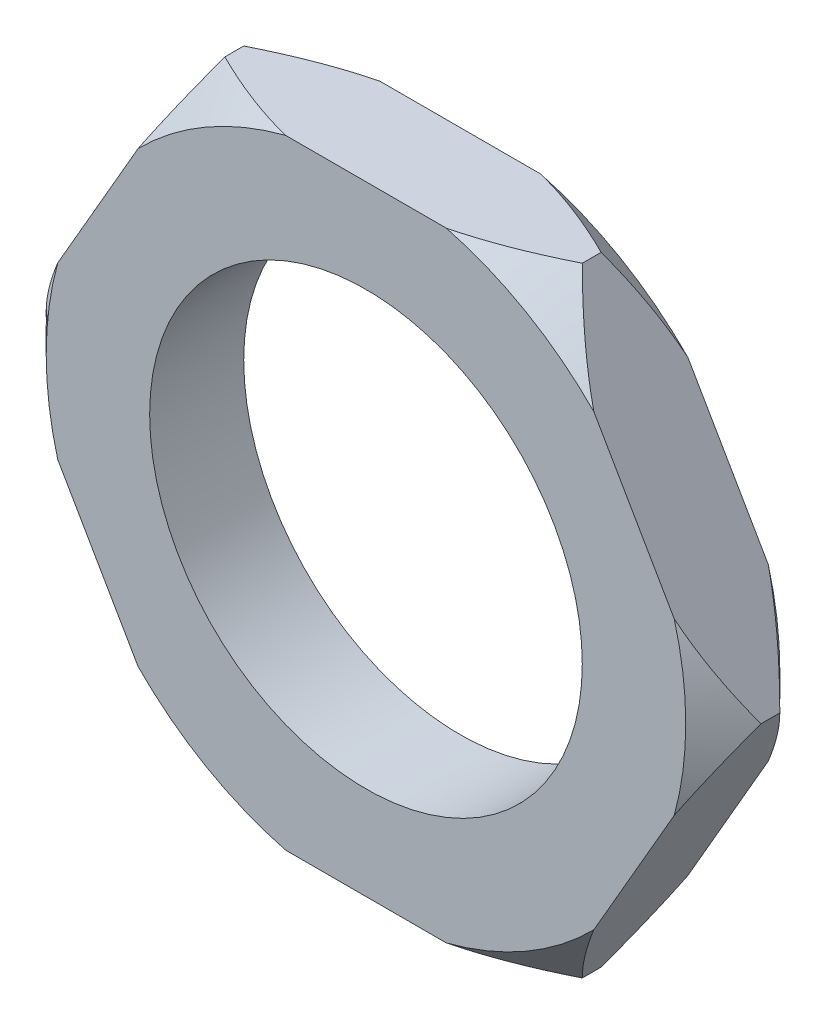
ISO-10303-21;
HEADER;
FILE_DESCRIPTION(('STEP AP214'),'2;1');
FILE_NAME('part.step','',(''),(''),'','','');
FILE_SCHEMA(('AUTOMOTIVE_DESIGN { 1 0 10303 214 1 1 1 1 }'));
ENDSEC;
DATA;
#1=APPLICATION_CONTEXT('core data for automotive mechanical design processes');
#2=APPLICATION_PROTOCOL_DEFINITION('international standard','automotive_design',2000,#1);
#3=PRODUCT_CONTEXT('',#1,'mechanical');
#4=PRODUCT('Part','Part','',(#3));
#5=PRODUCT_RELATED_PRODUCT_CATEGORY('part','',(#4));
#6=PRODUCT_DEFINITION_FORMATION('','',#4);
#7=PRODUCT_DEFINITION_CONTEXT('part definition',#1,'design');
#8=PRODUCT_DEFINITION('design','',#6,#7);
#9=PRODUCT_DEFINITION_SHAPE('','',#8);
#10=(LENGTH_UNIT() NAMED_UNIT(*) SI_UNIT(.MILLI.,.METRE.));
#11=(NAMED_UNIT(*) PLANE_ANGLE_UNIT() SI_UNIT($,.RADIAN.));
#12=(NAMED_UNIT(*) SI_UNIT($,.STERADIAN.) SOLID_ANGLE_UNIT());
#13=UNCERTAINTY_MEASURE_WITH_UNIT(LENGTH_MEASURE(1.E-05),#10,'distance_accuracy_value','');
#14=(GEOMETRIC_REPRESENTATION_CONTEXT(3) GLOBAL_UNCERTAINTY_ASSIGNED_CONTEXT((#13)) GLOBAL_UNIT_ASSIGNED_CONTEXT((#10,
#11,#12)) REPRESENTATION_CONTEXT('',''));
#15=CARTESIAN_POINT('',(0.,0.,0.));
#16=DIRECTION('',(0.,0.,1.));
#17=DIRECTION('',(1.,0.,0.));
#18=AXIS2_PLACEMENT_3D('',#15,#16,#17);
#19=CARTESIAN_POINT('',(0.,0.,2.5));
#20=DIRECTION('',(0.,0.,1.));
#21=DIRECTION('',(1.,0.,0.));
#22=AXIS2_PLACEMENT_3D('',#19,#20,#21);
#23=PLANE('',#22);
#24=CARTESIAN_POINT('',(0.,0.,2.5));
#25=DIRECTION('',(0.,0.,1.));
#26=DIRECTION('',(1.,0.,0.));
#27=AXIS2_PLACEMENT_3D('',#24,#25,#26);
#28=CIRCLE('',#27,5.75);
#29=CARTESIAN_POINT('',(5.75,0.,2.5));
#30=VERTEX_POINT('',#29);
#31=EDGE_CURVE('E196',#30,#30,#28,.T.);
#32=ORIENTED_EDGE('',*,*,#31,.F.);
#33=EDGE_LOOP('',(#32));
#34=FACE_BOUND('',#33,.T.);
#35=CARTESIAN_POINT('',(0.,0.,2.5));
#36=DIRECTION('',(0.,0.,1.));
#37=DIRECTION('',(1.,0.,0.));
#38=AXIS2_PLACEMENT_3D('',#35,#36,#37);
#39=CIRCLE('',#38,8.5);
#40=CARTESIAN_POINT('',(-2.13600093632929,8.22724133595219,2.5));
#41=VERTEX_POINT('',#40);
#42=CARTESIAN_POINT('',(-6.05699953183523,5.96345174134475,2.5));
#43=VERTEX_POINT('',#42);
#44=EDGE_CURVE('E187',#41,#43,#39,.T.);
#45=ORIENTED_EDGE('',*,*,#44,.T.);
#46=DIRECTION('',(-0.500000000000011,-0.866025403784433,0.));
#47=VECTOR('',#46,1.);
#48=CARTESIAN_POINT('',(-4.7499999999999,8.22724133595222,2.5));
#49=LINE('',#48,#47);
#50=CARTESIAN_POINT('',(-8.19300046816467,2.26378959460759,2.5));
#51=VERTEX_POINT('',#50);
#52=EDGE_CURVE('E175',#43,#51,#49,.T.);
#53=ORIENTED_EDGE('',*,*,#52,.T.);
#54=CARTESIAN_POINT('',(-8.19300046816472,-2.26378959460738,2.5));
#55=VERTEX_POINT('',#54);
#56=EDGE_CURVE('E181',#51,#55,#39,.T.);
#57=ORIENTED_EDGE('',*,*,#56,.T.);
#58=DIRECTION('',(0.499999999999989,-0.866025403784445,0.));
#59=VECTOR('',#58,1.);
#60=CARTESIAN_POINT('',(-9.5,1.15865650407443E-13,2.5));
#61=LINE('',#60,#59);
#62=CARTESIAN_POINT('',(-6.05699953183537,-5.96345174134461,2.5));
#63=VERTEX_POINT('',#62);
#64=EDGE_CURVE('E164',#55,#63,#61,.T.);
#65=ORIENTED_EDGE('',*,*,#64,.T.);
#66=CARTESIAN_POINT('',(-2.13600093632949,-8.22724133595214,2.5));
#67=VERTEX_POINT('',#66);
#68=EDGE_CURVE('E188',#63,#67,#39,.T.);
#69=ORIENTED_EDGE('',*,*,#68,.T.);
#70=DIRECTION('',(1.,0.,0.));
#71=VECTOR('',#70,1.);
#72=CARTESIAN_POINT('',(-4.7500000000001,-8.22724133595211,2.5));
#73=LINE('',#72,#71);
#74=CARTESIAN_POINT('',(2.13600093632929,-8.22724133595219,2.5));
#75=VERTEX_POINT('',#74);
#76=EDGE_CURVE('E174',#67,#75,#73,.T.);
#77=ORIENTED_EDGE('',*,*,#76,.T.);
#78=CARTESIAN_POINT('',(6.05699953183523,-5.96345174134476,2.5));
#79=VERTEX_POINT('',#78);
#80=EDGE_CURVE('E191',#75,#79,#39,.T.);
#81=ORIENTED_EDGE('',*,*,#80,.T.);
#82=DIRECTION('',(0.50000000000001,0.866025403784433,0.));
#83=VECTOR('',#82,1.);
#84=CARTESIAN_POINT('',(4.7499999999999,-8.22724133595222,2.5));
#85=LINE('',#84,#83);
#86=CARTESIAN_POINT('',(8.19300046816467,-2.26378959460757,2.5));
#87=VERTEX_POINT('',#86);
#88=EDGE_CURVE('E364',#79,#87,#85,.T.);
#89=ORIENTED_EDGE('',*,*,#88,.T.);
#90=CARTESIAN_POINT('',(8.19300046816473,2.26378959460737,2.5));
#91=VERTEX_POINT('',#90);
#92=EDGE_CURVE('E192',#87,#91,#39,.T.);
#93=ORIENTED_EDGE('',*,*,#92,.T.);
#94=DIRECTION('',(-0.49999999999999,0.866025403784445,0.));
#95=VECTOR('',#94,1.);
#96=CARTESIAN_POINT('',(9.49999999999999,-1.15882905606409E-13,2.5));
#97=LINE('',#96,#95);
#98=CARTESIAN_POINT('',(6.05699953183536,5.96345174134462,2.5));
#99=VERTEX_POINT('',#98);
#100=EDGE_CURVE('E366',#91,#99,#97,.T.);
#101=ORIENTED_EDGE('',*,*,#100,.T.);
#102=CARTESIAN_POINT('',(2.13600093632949,8.22724133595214,2.5));
#103=VERTEX_POINT('',#102);
#104=EDGE_CURVE('E190',#99,#103,#39,.T.);
#105=ORIENTED_EDGE('',*,*,#104,.T.);
#106=DIRECTION('',(-1.,0.,0.));
#107=VECTOR('',#106,1.);
#108=CARTESIAN_POINT('',(4.75000000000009,8.22724133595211,2.5));
#109=LINE('',#108,#107);
#110=EDGE_CURVE('E349',#103,#41,#109,.T.);
#111=ORIENTED_EDGE('',*,*,#110,.T.);
#112=EDGE_LOOP('',(#45,#53,#57,#65,#69,#77,#81,#89,#93,#101,#105,#111));
#113=FACE_BOUND('',#112,.T.);
#114=ADVANCED_FACE('F34',(#34,#113),#23,.T.);
#115=CARTESIAN_POINT('',(0.,0.,0.));
#116=DIRECTION('',(0.,0.,1.));
#117=DIRECTION('',(1.,0.,0.));
#118=AXIS2_PLACEMENT_3D('',#115,#116,#117);
#119=PLANE('',#118);
#120=CARTESIAN_POINT('',(0.,0.,0.));
#121=DIRECTION('',(0.,0.,1.));
#122=DIRECTION('',(1.,0.,0.));
#123=AXIS2_PLACEMENT_3D('',#120,#121,#122);
#124=CIRCLE('',#123,5.75);
#125=CARTESIAN_POINT('',(5.75,0.,0.));
#126=VERTEX_POINT('',#125);
#127=EDGE_CURVE('E197',#126,#126,#124,.T.);
#128=ORIENTED_EDGE('',*,*,#127,.T.);
#129=EDGE_LOOP('',(#128));
#130=FACE_BOUND('',#129,.T.);
#131=DIRECTION('',(-0.500000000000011,-0.866025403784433,0.));
#132=VECTOR('',#131,1.);
#133=CARTESIAN_POINT('',(-4.7499999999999,8.22724133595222,0.));
#134=LINE('',#133,#132);
#135=CARTESIAN_POINT('',(-6.05699953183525,5.96345174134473,0.));
#136=VERTEX_POINT('',#135);
#137=CARTESIAN_POINT('',(-8.19300046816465,2.26378959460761,0.));
#138=VERTEX_POINT('',#137);
#139=EDGE_CURVE('E320',#136,#138,#134,.T.);
#140=ORIENTED_EDGE('',*,*,#139,.F.);
#141=CARTESIAN_POINT('',(0.,0.,0.));
#142=DIRECTION('',(0.,0.,1.));
#143=DIRECTION('',(1.,0.,0.));
#144=AXIS2_PLACEMENT_3D('',#141,#142,#143);
#145=CIRCLE('',#144,8.49999999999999);
#146=CARTESIAN_POINT('',(-2.13600093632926,8.22724133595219,0.));
#147=VERTEX_POINT('',#146);
#148=EDGE_CURVE('E324',#136,#147,#145,.F.);
#149=ORIENTED_EDGE('',*,*,#148,.T.);
#150=DIRECTION('',(-1.,0.,0.));
#151=VECTOR('',#150,1.);
#152=CARTESIAN_POINT('',(4.75000000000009,8.22724133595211,0.));
#153=LINE('',#152,#151);
#154=CARTESIAN_POINT('',(2.13600093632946,8.22724133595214,0.));
#155=VERTEX_POINT('',#154);
#156=EDGE_CURVE('E331',#155,#147,#153,.T.);
#157=ORIENTED_EDGE('',*,*,#156,.F.);
#158=CARTESIAN_POINT('',(6.05699953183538,5.9634517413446,0.));
#159=VERTEX_POINT('',#158);
#160=EDGE_CURVE('E202',#155,#159,#145,.F.);
#161=ORIENTED_EDGE('',*,*,#160,.T.);
#162=DIRECTION('',(-0.49999999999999,0.866025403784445,0.));
#163=VECTOR('',#162,1.);
#164=CARTESIAN_POINT('',(9.49999999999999,-1.15882905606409E-13,0.));
#165=LINE('',#164,#163);
#166=CARTESIAN_POINT('',(8.19300046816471,2.26378959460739,0.));
#167=VERTEX_POINT('',#166);
#168=EDGE_CURVE('E329',#167,#159,#165,.T.);
#169=ORIENTED_EDGE('',*,*,#168,.F.);
#170=CARTESIAN_POINT('',(8.19300046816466,-2.2637895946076,0.));
#171=VERTEX_POINT('',#170);
#172=EDGE_CURVE('E199',#167,#171,#145,.F.);
#173=ORIENTED_EDGE('',*,*,#172,.T.);
#174=DIRECTION('',(0.50000000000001,0.866025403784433,0.));
#175=VECTOR('',#174,1.);
#176=CARTESIAN_POINT('',(4.7499999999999,-8.22724133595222,0.));
#177=LINE('',#176,#175);
#178=CARTESIAN_POINT('',(6.05699953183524,-5.96345174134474,0.));
#179=VERTEX_POINT('',#178);
#180=EDGE_CURVE('E357',#179,#171,#177,.T.);
#181=ORIENTED_EDGE('',*,*,#180,.F.);
#182=CARTESIAN_POINT('',(2.13600093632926,-8.22724133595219,0.));
#183=VERTEX_POINT('',#182);
#184=EDGE_CURVE('E203',#179,#183,#145,.F.);
#185=ORIENTED_EDGE('',*,*,#184,.T.);
#186=DIRECTION('',(1.,0.,0.));
#187=VECTOR('',#186,1.);
#188=CARTESIAN_POINT('',(-4.7500000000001,-8.22724133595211,0.));
#189=LINE('',#188,#187);
#190=CARTESIAN_POINT('',(-2.13600093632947,-8.22724133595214,0.));
#191=VERTEX_POINT('',#190);
#192=EDGE_CURVE('E373',#191,#183,#189,.T.);
#193=ORIENTED_EDGE('',*,*,#192,.F.);
#194=CARTESIAN_POINT('',(-6.05699953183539,-5.96345174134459,0.));
#195=VERTEX_POINT('',#194);
#196=EDGE_CURVE('E323',#191,#195,#145,.F.);
#197=ORIENTED_EDGE('',*,*,#196,.T.);
#198=DIRECTION('',(0.499999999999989,-0.866025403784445,0.));
#199=VECTOR('',#198,1.);
#200=CARTESIAN_POINT('',(-9.5,1.15865650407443E-13,0.));
#201=LINE('',#200,#199);
#202=CARTESIAN_POINT('',(-8.19300046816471,-2.2637895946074,0.));
#203=VERTEX_POINT('',#202);
#204=EDGE_CURVE('E322',#203,#195,#201,.T.);
#205=ORIENTED_EDGE('',*,*,#204,.F.);
#206=EDGE_CURVE('E314',#203,#138,#145,.F.);
#207=ORIENTED_EDGE('',*,*,#206,.T.);
#208=EDGE_LOOP('',(#140,#149,#157,#161,#169,#173,#181,#185,#193,#197,#205,#207));
#209=FACE_BOUND('',#208,.T.);
#210=ADVANCED_FACE('F242',(#130,#209),#119,.F.);
#211=CARTESIAN_POINT('',(0.,0.,2.5));
#212=DIRECTION('',(0.,0.,-1.));
#213=DIRECTION('',(-1.,0.,0.));
#214=AXIS2_PLACEMENT_3D('',#211,#212,#213);
#215=CONICAL_SURFACE('',#214,8.5,0.785398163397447);
#216=CARTESIAN_POINT('',(10.4816919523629,8.22724133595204,-2.32491524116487));
#217=CARTESIAN_POINT('',(10.246467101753,8.22724133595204,-2.13991478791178));
#218=CARTESIAN_POINT('',(10.0101104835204,8.22724133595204,-1.95633485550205));
#219=CARTESIAN_POINT('',(9.53469549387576,8.22724133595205,-1.59262677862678));
#220=CARTESIAN_POINT('',(9.29563667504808,8.22724133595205,-1.41249921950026));
#221=CARTESIAN_POINT('',(8.8132325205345,8.22724133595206,-1.05546234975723));
#222=CARTESIAN_POINT('',(8.56987155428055,8.22724133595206,-0.878574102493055));
#223=CARTESIAN_POINT('',(8.07957196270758,8.22724133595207,-0.529842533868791));
#224=CARTESIAN_POINT('',(7.83263352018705,8.22724133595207,-0.357998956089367));
#225=CARTESIAN_POINT('',(7.32222201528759,8.22724133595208,-0.0120605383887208));
#226=CARTESIAN_POINT('',(7.05853676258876,8.22724133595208,0.161722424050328));
#227=CARTESIAN_POINT('',(6.52576475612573,8.22724133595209,0.500910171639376));
#228=CARTESIAN_POINT('',(6.25667739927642,8.22724133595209,0.666314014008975));
#229=CARTESIAN_POINT('',(5.71279742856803,8.2272413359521,0.986245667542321));
#230=CARTESIAN_POINT('',(5.4380172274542,8.2272413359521,1.14079445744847));
#231=CARTESIAN_POINT('',(4.88140066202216,8.22724133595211,1.43652844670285));
#232=CARTESIAN_POINT('',(4.5995665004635,8.22724133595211,1.57771775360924));
#233=CARTESIAN_POINT('',(4.05771250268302,8.22724133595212,1.82933258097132));
#234=CARTESIAN_POINT('',(3.79847506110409,8.22724133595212,1.94143053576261));
#235=CARTESIAN_POINT('',(3.27325369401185,8.22724133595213,2.14881381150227));
#236=CARTESIAN_POINT('',(3.00726912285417,8.22724133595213,2.24409751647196));
#237=CARTESIAN_POINT('',(2.47184798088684,8.22724133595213,2.41316008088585));
#238=CARTESIAN_POINT('',(2.20248700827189,8.22724133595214,2.48717510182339));
#239=CARTESIAN_POINT('',(1.65829062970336,8.22724133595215,2.61147572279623));
#240=CARTESIAN_POINT('',(1.3834559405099,8.22724133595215,2.66176440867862));
#241=CARTESIAN_POINT('',(0.825018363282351,8.22724133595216,2.73620750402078));
#242=CARTESIAN_POINT('',(0.541347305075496,8.22724133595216,2.75986163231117));
#243=CARTESIAN_POINT('',(-0.0269119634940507,8.22724133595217,2.77761596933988));
#244=CARTESIAN_POINT('',(-0.311500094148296,8.22724133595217,2.77171868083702));
#245=CARTESIAN_POINT('',(-0.879416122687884,8.22724133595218,2.73075785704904));
#246=CARTESIAN_POINT('',(-1.16273737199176,8.22724133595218,2.69560389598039));
#247=CARTESIAN_POINT('',(-1.72471908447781,8.22724133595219,2.5984868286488));
#248=CARTESIAN_POINT('',(-2.00337827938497,8.22724133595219,2.53651654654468));
#249=CARTESIAN_POINT('',(-2.64081854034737,8.2272413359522,2.36636052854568));
#250=CARTESIAN_POINT('',(-2.99733991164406,8.2272413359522,2.24977755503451));
#251=CARTESIAN_POINT('',(-3.69858880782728,8.22724133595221,1.98549725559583));
#252=CARTESIAN_POINT('',(-4.04330904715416,8.22724133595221,1.83778109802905));
#253=CARTESIAN_POINT('',(-4.72401988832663,8.22724133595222,1.51775452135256));
#254=CARTESIAN_POINT('',(-5.05992970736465,8.22724133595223,1.34527458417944));
#255=CARTESIAN_POINT('',(-5.72178529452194,8.22724133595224,0.982527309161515));
#256=CARTESIAN_POINT('',(-6.04773339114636,8.22724133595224,0.792264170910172));
#257=CARTESIAN_POINT('',(-6.73217739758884,8.22724133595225,0.373267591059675));
#258=CARTESIAN_POINT('',(-7.08955311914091,8.22724133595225,0.142716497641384));
#259=CARTESIAN_POINT('',(-7.79581653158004,8.22724133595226,-0.331097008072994));
#260=CARTESIAN_POINT('',(-8.14470242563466,8.22724133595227,-0.57436207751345));
#261=CARTESIAN_POINT('',(-8.82800236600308,8.22724133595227,-1.06506851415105));
#262=CARTESIAN_POINT('',(-9.16256604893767,8.22724133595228,-1.31230235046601));
#263=CARTESIAN_POINT('',(-9.66023792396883,8.22724133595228,-1.68841817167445));
#264=CARTESIAN_POINT('',(-9.82537954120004,8.22724133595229,-1.81462543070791));
#265=CARTESIAN_POINT('',(-10.1544284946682,8.22724133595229,-2.06862647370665));
#266=CARTESIAN_POINT('',(-10.3183358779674,8.22724133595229,-2.19642019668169));
#267=CARTESIAN_POINT('',(-10.4816919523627,8.22724133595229,-2.32491524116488));
#268=B_SPLINE_CURVE_WITH_KNOTS('',3,(#216,#217,#218,#219,#220,#221,#222,#223,#224,#225,#226,
#227,#228,#229,#230,#231,#232,#233,#234,#235,#236,#237,#238,#239,#240,#241,#242,#243,#244,#245,
#246,#247,#248,#249,#250,#251,#252,#253,#254,#255,#256,#257,#258,#259,#260,#261,#262,#263,#264,
#265,#266,#267),.UNSPECIFIED.,.F.,.F.,(4,2,2,2,2,2,2,2,2,2,2,2,2,2,2,2,2,2,2,2,2,2,2,2,2,4),(0.,
0.89778824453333,1.79572738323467,2.69823982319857,3.60070630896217,4.54798252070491,
5.49536507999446,6.44086323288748,7.38606972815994,8.23290375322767,9.07981912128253,
9.91693104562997,10.7539340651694,11.6064092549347,12.4588122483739,13.3138596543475,
14.169136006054,15.2924569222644,16.4164592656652,17.5485592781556,18.6803926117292,
19.9558908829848,21.2316568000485,22.4795352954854,23.1030662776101,23.7265733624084),.UNSPECIFIED.);
#269=CARTESIAN_POINT('',(-4.7499999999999,8.22724133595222,1.5));
#270=VERTEX_POINT('',#269);
#271=EDGE_CURVE('E263',#41,#270,#268,.T.);
#272=ORIENTED_EDGE('',*,*,#271,.T.);
#273=CARTESIAN_POINT('',(-1.44080610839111,13.9589332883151,-3.0330944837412));
#274=CARTESIAN_POINT('',(-1.55348688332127,13.7637644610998,-2.85054783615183));
#275=CARTESIAN_POINT('',(-1.6666162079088,13.5678187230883,-2.66909859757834));
#276=CARTESIAN_POINT('',(-1.89392770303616,13.1741036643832,-2.30881618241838));
#277=CARTESIAN_POINT('',(-2.00810996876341,12.9763341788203,-2.12998324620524));
#278=CARTESIAN_POINT('',(-2.23793842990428,12.578259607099,-1.77496204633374));
#279=CARTESIAN_POINT('',(-2.35358748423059,12.3779495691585,-1.59878117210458));
#280=CARTESIAN_POINT('',(-2.58625569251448,11.9749564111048,-1.25008359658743));
#281=CARTESIAN_POINT('',(-2.70327480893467,11.7722733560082,-1.07756679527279));
#282=CARTESIAN_POINT('',(-2.9421769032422,11.358482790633,-0.732157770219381));
#283=CARTESIAN_POINT('',(-3.06410457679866,11.1472978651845,-0.559388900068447));
#284=CARTESIAN_POINT('',(-3.30989472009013,10.7215768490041,-0.219451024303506));
#285=CARTESIAN_POINT('',(-3.43375711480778,10.507040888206,-0.0522818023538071));
#286=CARTESIAN_POINT('',(-3.68362460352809,10.0742577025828,0.275069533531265));
#287=CARTESIAN_POINT('',(-3.80962775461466,9.85601384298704,0.435257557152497));
#288=CARTESIAN_POINT('',(-4.06421683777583,9.41505261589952,0.747167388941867));
#289=CARTESIAN_POINT('',(-4.19280243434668,9.19233582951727,0.898890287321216));
#290=CARTESIAN_POINT('',(-4.45569824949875,8.73698692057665,1.19490070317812));
#291=CARTESIAN_POINT('',(-4.59007200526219,8.50424474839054,1.33896400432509));
#292=CARTESIAN_POINT('',(-4.86235295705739,8.03264030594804,1.61328271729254));
#293=CARTESIAN_POINT('',(-5.00026065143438,7.79377717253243,1.74353616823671));
#294=CARTESIAN_POINT('',(-5.27914481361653,7.31073563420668,1.98592793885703));
#295=CARTESIAN_POINT('',(-5.42010042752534,7.06659334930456,2.09816123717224));
#296=CARTESIAN_POINT('',(-5.70586552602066,6.57163367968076,2.30103324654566));
#297=CARTESIAN_POINT('',(-5.8506738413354,6.32081832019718,2.39167842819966));
#298=CARTESIAN_POINT('',(-6.11539834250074,5.8623020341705,2.53166207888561));
#299=CARTESIAN_POINT('',(-6.23470295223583,5.65566038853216,2.58560068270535));
#300=CARTESIAN_POINT('',(-6.47510898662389,5.23926492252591,2.67406727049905));
#301=CARTESIAN_POINT('',(-6.59621014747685,5.02951155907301,2.70859807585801));
#302=CARTESIAN_POINT('',(-6.83925892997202,4.60853871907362,2.75647397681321));
#303=CARTESIAN_POINT('',(-6.96120473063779,4.39732239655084,2.76985552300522));
#304=CARTESIAN_POINT('',(-7.20521073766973,3.97469159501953,2.77481265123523));
#305=CARTESIAN_POINT('',(-7.32727094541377,3.76327711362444,2.76638796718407));
#306=CARTESIAN_POINT('',(-7.57021256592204,3.34248988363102,2.72825110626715));
#307=CARTESIAN_POINT('',(-7.69109626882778,3.13311316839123,2.6985963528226));
#308=CARTESIAN_POINT('',(-7.93122953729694,2.71719014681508,2.61958382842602));
#309=CARTESIAN_POINT('',(-8.05047896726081,2.51064407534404,2.5702244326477));
#310=CARTESIAN_POINT('',(-8.28715588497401,2.10070762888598,2.45382562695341));
#311=CARTESIAN_POINT('',(-8.40457679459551,1.8973286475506,2.38673335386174));
#312=CARTESIAN_POINT('',(-8.63695068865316,1.49484525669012,2.23740687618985));
#313=CARTESIAN_POINT('',(-8.75190379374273,1.2957406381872,2.15517341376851));
#314=CARTESIAN_POINT('',(-9.02061195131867,0.830324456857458,1.94575840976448));
#315=CARTESIAN_POINT('',(-9.17329577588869,0.565868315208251,1.813099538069));
#316=CARTESIAN_POINT('',(-9.47433883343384,0.0444464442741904,1.52928109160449));
#317=CARTESIAN_POINT('',(-9.62269558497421,-0.212514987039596,1.37811114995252));
#318=CARTESIAN_POINT('',(-9.91581392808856,-0.720210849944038,1.06112886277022));
#319=CARTESIAN_POINT('',(-10.060567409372,-0.970931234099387,0.895286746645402));
#320=CARTESIAN_POINT('',(-10.3466689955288,-1.46647371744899,0.552432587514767));
#321=CARTESIAN_POINT('',(-10.4880177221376,-1.71129689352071,0.37542260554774));
#322=CARTESIAN_POINT('',(-10.768480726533,-2.19707306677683,0.0117552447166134));
#323=CARTESIAN_POINT('',(-10.9075818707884,-2.43800331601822,-0.174942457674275));
#324=CARTESIAN_POINT('',(-11.1833352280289,-2.9156221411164,-0.555432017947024));
#325=CARTESIAN_POINT('',(-11.3199873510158,-3.15231056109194,-0.749224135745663));
#326=CARTESIAN_POINT('',(-11.5910720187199,-3.62184297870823,-1.14231824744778));
#327=CARTESIAN_POINT('',(-11.7255067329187,-3.85469073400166,-1.34161427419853));
#328=CARTESIAN_POINT('',(-11.9926118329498,-4.31733033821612,-1.74485771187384));
#329=CARTESIAN_POINT('',(-12.1252822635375,-4.54712226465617,-1.94880500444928));
#330=CARTESIAN_POINT('',(-12.3500822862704,-4.93648732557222,-2.29962217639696));
#331=CARTESIAN_POINT('',(-12.4425909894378,-5.0967170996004,-2.44552307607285));
#332=CARTESIAN_POINT('',(-12.6265610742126,-5.41536263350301,-2.73840976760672));
#333=CARTESIAN_POINT('',(-12.7180251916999,-5.5737831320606,-2.88538868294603));
#334=CARTESIAN_POINT('',(-12.8091938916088,-5.73169195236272,-3.0330944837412));
#335=B_SPLINE_CURVE_WITH_KNOTS('',3,(#273,#274,#275,#276,#277,#278,#279,#280,#281,#282,#283,
#284,#285,#286,#287,#288,#289,#290,#291,#292,#293,#294,#295,#296,#297,#298,#299,#300,#301,#302,
#303,#304,#305,#306,#307,#308,#309,#310,#311,#312,#313,#314,#315,#316,#317,#318,#319,#320,#321,
#322,#323,#324,#325,#326,#327,#328,#329,#330,#331,#332,#333,#334),.UNSPECIFIED.,.F.,.F.,(4,2,2,
2,2,2,2,2,2,2,2,2,2,2,2,2,2,2,2,2,2,2,2,2,2,2,2,2,2,2,4),(0.,0.870063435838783,1.74020631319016,
2.61244054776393,3.4846509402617,4.38115250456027,5.27761939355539,6.17331205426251,
7.0688890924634,7.98334864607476,8.89793787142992,9.8075360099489,10.7168611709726,
11.4500495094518,12.183131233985,12.9149481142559,13.6467739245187,14.3766277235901,
15.1065417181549,15.8386566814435,16.5707357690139,17.5687083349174,18.567242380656,
19.567851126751,20.5682757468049,21.5732638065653,22.578288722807,23.5822637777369,
24.5862133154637,25.2930750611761,25.9970461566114),.UNSPECIFIED.);
#336=EDGE_CURVE('E343',#270,#43,#335,.T.);
#337=ORIENTED_EDGE('',*,*,#336,.T.);
#338=ORIENTED_EDGE('',*,*,#44,.F.);
#339=EDGE_LOOP('',(#272,#337,#338));
#340=FACE_BOUND('',#339,.T.);
#341=ADVANCED_FACE('F237',(#340),#215,.T.);
#342=CARTESIAN_POINT('',(12.8091938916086,-5.73169195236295,-3.03309448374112));
#343=CARTESIAN_POINT('',(12.6965131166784,-5.53652312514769,-2.85054783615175));
#344=CARTESIAN_POINT('',(12.5833837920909,-5.34057738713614,-2.66909859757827));
#345=CARTESIAN_POINT('',(12.3560722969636,-4.94686232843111,-2.3088161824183));
#346=CARTESIAN_POINT('',(12.2418900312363,-4.74909284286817,-2.12998324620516));
#347=CARTESIAN_POINT('',(12.0120615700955,-4.35101827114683,-1.77496204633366));
#348=CARTESIAN_POINT('',(11.8964125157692,-4.15070823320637,-1.5987811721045));
#349=CARTESIAN_POINT('',(11.6637443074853,-3.74771507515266,-1.25008359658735));
#350=CARTESIAN_POINT('',(11.5467251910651,-3.54503202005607,-1.07756679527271));
#351=CARTESIAN_POINT('',(11.3078230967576,-3.13124145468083,-0.732157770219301));
#352=CARTESIAN_POINT('',(11.1858954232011,-2.92005652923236,-0.559388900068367));
#353=CARTESIAN_POINT('',(10.9401052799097,-2.49433551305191,-0.219451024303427));
#354=CARTESIAN_POINT('',(10.816242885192,-2.27979955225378,-0.0522818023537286));
#355=CARTESIAN_POINT('',(10.5663753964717,-1.84701636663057,0.275069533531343));
#356=CARTESIAN_POINT('',(10.4403722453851,-1.62877250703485,0.435257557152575));
#357=CARTESIAN_POINT('',(10.185783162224,-1.18781127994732,0.747167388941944));
#358=CARTESIAN_POINT('',(10.0571975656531,-0.965094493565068,0.898890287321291));
#359=CARTESIAN_POINT('',(9.79430175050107,-0.509745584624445,1.19490070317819));
#360=CARTESIAN_POINT('',(9.65992799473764,-0.277003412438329,1.33896400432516));
#361=CARTESIAN_POINT('',(9.38764704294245,0.194601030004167,1.6132827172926));
#362=CARTESIAN_POINT('',(9.24973934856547,0.433464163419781,1.74353616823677));
#363=CARTESIAN_POINT('',(8.97085518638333,0.916505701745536,1.98592793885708));
#364=CARTESIAN_POINT('',(8.82989957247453,1.16064798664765,2.09816123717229));
#365=CARTESIAN_POINT('',(8.54413447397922,1.65560765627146,2.3010332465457));
#366=CARTESIAN_POINT('',(8.39932615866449,1.90642301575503,2.39167842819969));
#367=CARTESIAN_POINT('',(8.13460165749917,2.36493930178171,2.53166207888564));
#368=CARTESIAN_POINT('',(8.01529704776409,2.57158094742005,2.58560068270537));
#369=CARTESIAN_POINT('',(7.77489101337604,2.98797641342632,2.67406727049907));
#370=CARTESIAN_POINT('',(7.65378985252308,3.19772977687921,2.70859807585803));
#371=CARTESIAN_POINT('',(7.41074107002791,3.61870261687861,2.75647397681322));
#372=CARTESIAN_POINT('',(7.28879526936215,3.82991893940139,2.76985552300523));
#373=CARTESIAN_POINT('',(7.04478926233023,4.25254974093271,2.77481265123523));
#374=CARTESIAN_POINT('',(6.92272905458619,4.4639642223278,2.76638796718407));
#375=CARTESIAN_POINT('',(6.67978743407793,4.88475145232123,2.72825110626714));
#376=CARTESIAN_POINT('',(6.5589037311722,5.09412816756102,2.69859635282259));
#377=CARTESIAN_POINT('',(6.31877046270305,5.51005118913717,2.61958382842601));
#378=CARTESIAN_POINT('',(6.19952103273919,5.71659726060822,2.57022443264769));
#379=CARTESIAN_POINT('',(5.96284411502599,6.12653370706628,2.45382562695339));
#380=CARTESIAN_POINT('',(5.8454232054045,6.32991268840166,2.38673335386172));
#381=CARTESIAN_POINT('',(5.61304931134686,6.73239607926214,2.23740687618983));
#382=CARTESIAN_POINT('',(5.4980962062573,6.93150069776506,2.15517341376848));
#383=CARTESIAN_POINT('',(5.22938804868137,7.39691687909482,1.94575840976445));
#384=CARTESIAN_POINT('',(5.07670422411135,7.66137302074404,1.81309953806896));
#385=CARTESIAN_POINT('',(4.77566116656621,8.18279489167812,1.52928109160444));
#386=CARTESIAN_POINT('',(4.62730441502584,8.43975632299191,1.37811114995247));
#387=CARTESIAN_POINT('',(4.3341860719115,8.94745218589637,1.06112886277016));
#388=CARTESIAN_POINT('',(4.18943259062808,9.19817257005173,0.895286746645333));
#389=CARTESIAN_POINT('',(3.90333100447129,9.69371505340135,0.552432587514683));
#390=CARTESIAN_POINT('',(3.76198227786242,9.93853822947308,0.37542260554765));
#391=CARTESIAN_POINT('',(3.48151927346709,10.4243144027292,0.0117552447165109));
#392=CARTESIAN_POINT('',(3.34241812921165,10.6652446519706,-0.174942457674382));
#393=CARTESIAN_POINT('',(3.06666477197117,11.1428634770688,-0.555432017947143));
#394=CARTESIAN_POINT('',(2.93001264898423,11.3795518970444,-0.749224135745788));
#395=CARTESIAN_POINT('',(2.65892798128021,11.8490843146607,-1.14231824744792));
#396=CARTESIAN_POINT('',(2.52449326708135,12.0819320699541,-1.34161427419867));
#397=CARTESIAN_POINT('',(2.25738816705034,12.5445716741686,-1.744857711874));
#398=CARTESIAN_POINT('',(2.12471773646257,12.7743636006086,-1.94880500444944));
#399=CARTESIAN_POINT('',(1.89991771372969,13.1637286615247,-2.29962217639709));
#400=CARTESIAN_POINT('',(1.80740901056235,13.3239584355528,-2.44552307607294));
#401=CARTESIAN_POINT('',(1.62343892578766,13.6426039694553,-2.73840976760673));
#402=CARTESIAN_POINT('',(1.53197480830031,13.8010244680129,-2.885388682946));
#403=CARTESIAN_POINT('',(1.44080610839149,13.9589332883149,-3.03309448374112));
#404=B_SPLINE_CURVE_WITH_KNOTS('',3,(#342,#343,#344,#345,#346,#347,#348,#349,#350,#351,#352,
#353,#354,#355,#356,#357,#358,#359,#360,#361,#362,#363,#364,#365,#366,#367,#368,#369,#370,#371,
#372,#373,#374,#375,#376,#377,#378,#379,#380,#381,#382,#383,#384,#385,#386,#387,#388,#389,#390,
#391,#392,#393,#394,#395,#396,#397,#398,#399,#400,#401,#402,#403),.UNSPECIFIED.,.F.,.F.,(4,2,2,
2,2,2,2,2,2,2,2,2,2,2,2,2,2,2,2,2,2,2,2,2,2,2,2,2,2,2,4),(0.,0.870063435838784,1.74020631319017,
2.61244054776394,3.48465094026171,4.38115250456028,5.27761939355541,6.17331205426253,
7.06888909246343,7.98334864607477,8.89793787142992,9.80753600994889,10.7168611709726,
11.4500495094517,12.183131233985,12.9149481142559,13.6467739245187,14.3766277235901,
15.1065417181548,15.8386566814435,16.5707357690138,17.5687083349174,18.5672423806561,
19.5678511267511,20.568275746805,21.5732638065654,22.5782887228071,23.5822637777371,
24.5862133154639,25.2930750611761,25.9970461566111),.UNSPECIFIED.);
#405=CARTESIAN_POINT('',(4.75000000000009,8.22724133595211,1.5));
#406=VERTEX_POINT('',#405);
#407=EDGE_CURVE('E257',#99,#406,#404,.T.);
#408=ORIENTED_EDGE('',*,*,#407,.T.);
#409=EDGE_CURVE('E268',#406,#103,#268,.T.);
#410=ORIENTED_EDGE('',*,*,#409,.T.);
#411=ORIENTED_EDGE('',*,*,#104,.F.);
#412=EDGE_LOOP('',(#408,#410,#411));
#413=FACE_BOUND('',#412,.T.);
#414=ADVANCED_FACE('F241',(#413),#215,.T.);
#415=CARTESIAN_POINT('',(1.44080610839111,-13.9589332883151,-3.0330944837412));
#416=CARTESIAN_POINT('',(1.55348688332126,-13.7637644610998,-2.85054783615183));
#417=CARTESIAN_POINT('',(1.66661620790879,-13.5678187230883,-2.66909859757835));
#418=CARTESIAN_POINT('',(1.89392770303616,-13.1741036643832,-2.30881618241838));
#419=CARTESIAN_POINT('',(2.00810996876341,-12.9763341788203,-2.12998324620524));
#420=CARTESIAN_POINT('',(2.23793842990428,-12.578259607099,-1.77496204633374));
#421=CARTESIAN_POINT('',(2.35358748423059,-12.3779495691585,-1.59878117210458));
#422=CARTESIAN_POINT('',(2.58625569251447,-11.9749564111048,-1.25008359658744));
#423=CARTESIAN_POINT('',(2.70327480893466,-11.7722733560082,-1.07756679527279));
#424=CARTESIAN_POINT('',(2.94217690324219,-11.358482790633,-0.732157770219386));
#425=CARTESIAN_POINT('',(3.06410457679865,-11.1472978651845,-0.559388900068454));
#426=CARTESIAN_POINT('',(3.30989472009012,-10.7215768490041,-0.219451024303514));
#427=CARTESIAN_POINT('',(3.43375711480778,-10.507040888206,-0.0522818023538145));
#428=CARTESIAN_POINT('',(3.68362460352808,-10.0742577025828,0.275069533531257));
#429=CARTESIAN_POINT('',(3.80962775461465,-9.85601384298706,0.435257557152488));
#430=CARTESIAN_POINT('',(4.06421683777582,-9.41505261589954,0.747167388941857));
#431=CARTESIAN_POINT('',(4.19280243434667,-9.19233582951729,0.898890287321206));
#432=CARTESIAN_POINT('',(4.45569824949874,-8.73698692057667,1.19490070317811));
#433=CARTESIAN_POINT('',(4.59007200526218,-8.50424474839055,1.33896400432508));
#434=CARTESIAN_POINT('',(4.86235295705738,-8.03264030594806,1.61328271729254));
#435=CARTESIAN_POINT('',(5.00026065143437,-7.79377717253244,1.74353616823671));
#436=CARTESIAN_POINT('',(5.27914481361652,-7.31073563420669,1.98592793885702));
#437=CARTESIAN_POINT('',(5.42010042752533,-7.06659334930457,2.09816123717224));
#438=CARTESIAN_POINT('',(5.70586552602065,-6.57163367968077,2.30103324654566));
#439=CARTESIAN_POINT('',(5.85067384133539,-6.32081832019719,2.39167842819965));
#440=CARTESIAN_POINT('',(6.11539834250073,-5.86230203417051,2.53166207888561));
#441=CARTESIAN_POINT('',(6.23470295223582,-5.65566038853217,2.58560068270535));
#442=CARTESIAN_POINT('',(6.47510898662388,-5.23926492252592,2.67406727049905));
#443=CARTESIAN_POINT('',(6.59621014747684,-5.02951155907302,2.70859807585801));
#444=CARTESIAN_POINT('',(6.83925892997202,-4.60853871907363,2.75647397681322));
#445=CARTESIAN_POINT('',(6.96120473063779,-4.39732239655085,2.76985552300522));
#446=CARTESIAN_POINT('',(7.20521073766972,-3.97469159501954,2.77481265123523));
#447=CARTESIAN_POINT('',(7.32727094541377,-3.76327711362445,2.76638796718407));
#448=CARTESIAN_POINT('',(7.57021256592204,-3.34248988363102,2.72825110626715));
#449=CARTESIAN_POINT('',(7.69109626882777,-3.13311316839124,2.6985963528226));
#450=CARTESIAN_POINT('',(7.93122953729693,-2.71719014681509,2.61958382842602));
#451=CARTESIAN_POINT('',(8.0504789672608,-2.51064407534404,2.5702244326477));
#452=CARTESIAN_POINT('',(8.287155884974,-2.10070762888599,2.45382562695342));
#453=CARTESIAN_POINT('',(8.4045767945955,-1.8973286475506,2.38673335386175));
#454=CARTESIAN_POINT('',(8.63695068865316,-1.49484525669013,2.23740687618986));
#455=CARTESIAN_POINT('',(8.75190379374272,-1.29574063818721,2.15517341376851));
#456=CARTESIAN_POINT('',(9.02061195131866,-0.830324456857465,1.94575840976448));
#457=CARTESIAN_POINT('',(9.17329577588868,-0.565868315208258,1.813099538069));
#458=CARTESIAN_POINT('',(9.47433883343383,-0.0444464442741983,1.52928109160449));
#459=CARTESIAN_POINT('',(9.6226955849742,0.212514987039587,1.37811114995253));
#460=CARTESIAN_POINT('',(9.91581392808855,0.720210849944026,1.06112886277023));
#461=CARTESIAN_POINT('',(10.060567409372,0.970931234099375,0.895286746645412));
#462=CARTESIAN_POINT('',(10.3466689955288,1.46647371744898,0.552432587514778));
#463=CARTESIAN_POINT('',(10.4880177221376,1.71129689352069,0.375422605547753));
#464=CARTESIAN_POINT('',(10.768480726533,2.19707306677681,0.0117552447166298));
#465=CARTESIAN_POINT('',(10.9075818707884,2.4380033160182,-0.174942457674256));
#466=CARTESIAN_POINT('',(11.1833352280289,2.91562214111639,-0.555432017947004));
#467=CARTESIAN_POINT('',(11.3199873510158,3.15231056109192,-0.749224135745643));
#468=CARTESIAN_POINT('',(11.5910720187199,3.6218429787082,-1.14231824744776));
#469=CARTESIAN_POINT('',(11.7255067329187,3.85469073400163,-1.34161427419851));
#470=CARTESIAN_POINT('',(11.9926118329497,4.31733033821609,-1.74485771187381));
#471=CARTESIAN_POINT('',(12.1252822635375,4.54712226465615,-1.94880500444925));
#472=CARTESIAN_POINT('',(12.3500822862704,4.9364873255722,-2.29962217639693));
#473=CARTESIAN_POINT('',(12.4425909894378,5.09671709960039,-2.44552307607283));
#474=CARTESIAN_POINT('',(12.6265610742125,5.415362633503,-2.73840976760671));
#475=CARTESIAN_POINT('',(12.7180251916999,5.5737831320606,-2.88538868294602));
#476=CARTESIAN_POINT('',(12.8091938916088,5.73169195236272,-3.03309448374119));
#477=B_SPLINE_CURVE_WITH_KNOTS('',3,(#415,#416,#417,#418,#419,#420,#421,#422,#423,#424,#425,
#426,#427,#428,#429,#430,#431,#432,#433,#434,#435,#436,#437,#438,#439,#440,#441,#442,#443,#444,
#445,#446,#447,#448,#449,#450,#451,#452,#453,#454,#455,#456,#457,#458,#459,#460,#461,#462,#463,
#464,#465,#466,#467,#468,#469,#470,#471,#472,#473,#474,#475,#476),.UNSPECIFIED.,.F.,.F.,(4,2,2,
2,2,2,2,2,2,2,2,2,2,2,2,2,2,2,2,2,2,2,2,2,2,2,2,2,2,2,4),(0.,0.87006343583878,1.74020631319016,
2.61244054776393,3.48465094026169,4.38115250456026,5.27761939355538,6.17331205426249,
7.06888909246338,7.98334864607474,8.8979378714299,9.80753600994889,10.7168611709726,
11.4500495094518,12.183131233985,12.9149481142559,13.6467739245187,14.3766277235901,
15.1065417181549,15.8386566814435,16.5707357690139,17.5687083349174,18.567242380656,
19.567851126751,20.5682757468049,21.5732638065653,22.578288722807,23.5822637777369,
24.5862133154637,25.2930750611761,25.9970461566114),.UNSPECIFIED.);
#478=CARTESIAN_POINT('',(9.49999999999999,-1.15882905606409E-13,1.5));
#479=VERTEX_POINT('',#478);
#480=EDGE_CURVE('E252',#87,#479,#477,.T.);
#481=ORIENTED_EDGE('',*,*,#480,.T.);
#482=EDGE_CURVE('E269',#479,#91,#404,.T.);
#483=ORIENTED_EDGE('',*,*,#482,.T.);
#484=ORIENTED_EDGE('',*,*,#92,.F.);
#485=EDGE_LOOP('',(#481,#483,#484));
#486=FACE_BOUND('',#485,.T.);
#487=ADVANCED_FACE('F389',(#486),#215,.T.);
#488=CARTESIAN_POINT('',(-10.4816919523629,-8.22724133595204,-2.32491524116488));
#489=CARTESIAN_POINT('',(-10.246467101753,-8.22724133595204,-2.13991478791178));
#490=CARTESIAN_POINT('',(-10.0101104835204,-8.22724133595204,-1.95633485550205));
#491=CARTESIAN_POINT('',(-9.53469549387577,-8.22724133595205,-1.59262677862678));
#492=CARTESIAN_POINT('',(-9.29563667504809,-8.22724133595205,-1.41249921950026));
#493=CARTESIAN_POINT('',(-8.81323252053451,-8.22724133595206,-1.05546234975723));
#494=CARTESIAN_POINT('',(-8.56987155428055,-8.22724133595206,-0.87857410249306));
#495=CARTESIAN_POINT('',(-8.0795719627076,-8.22724133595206,-0.529842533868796));
#496=CARTESIAN_POINT('',(-7.83263352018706,-8.22724133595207,-0.35799895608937));
#497=CARTESIAN_POINT('',(-7.3222220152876,-8.22724133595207,-0.0120605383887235));
#498=CARTESIAN_POINT('',(-7.05853676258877,-8.22724133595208,0.161722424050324));
#499=CARTESIAN_POINT('',(-6.52576475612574,-8.22724133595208,0.500910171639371));
#500=CARTESIAN_POINT('',(-6.25667739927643,-8.22724133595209,0.666314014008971));
#501=CARTESIAN_POINT('',(-5.71279742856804,-8.22724133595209,0.986245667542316));
#502=CARTESIAN_POINT('',(-5.43801722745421,-8.2272413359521,1.14079445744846));
#503=CARTESIAN_POINT('',(-4.88140066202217,-8.2272413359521,1.43652844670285));
#504=CARTESIAN_POINT('',(-4.5995665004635,-8.22724133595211,1.57771775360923));
#505=CARTESIAN_POINT('',(-4.05771250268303,-8.22724133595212,1.82933258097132));
#506=CARTESIAN_POINT('',(-3.7984750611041,-8.22724133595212,1.94143053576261));
#507=CARTESIAN_POINT('',(-3.27325369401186,-8.22724133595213,2.14881381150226));
#508=CARTESIAN_POINT('',(-3.00726912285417,-8.22724133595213,2.24409751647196));
#509=CARTESIAN_POINT('',(-2.47184798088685,-8.22724133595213,2.41316008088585));
#510=CARTESIAN_POINT('',(-2.2024870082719,-8.22724133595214,2.48717510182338));
#511=CARTESIAN_POINT('',(-1.65829062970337,-8.22724133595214,2.61147572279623));
#512=CARTESIAN_POINT('',(-1.38345594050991,-8.22724133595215,2.66176440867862));
#513=CARTESIAN_POINT('',(-0.825018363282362,-8.22724133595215,2.73620750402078));
#514=CARTESIAN_POINT('',(-0.541347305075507,-8.22724133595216,2.75986163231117));
#515=CARTESIAN_POINT('',(0.0269119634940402,-8.22724133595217,2.77761596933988));
#516=CARTESIAN_POINT('',(0.311500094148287,-8.22724133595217,2.77171868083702));
#517=CARTESIAN_POINT('',(0.879416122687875,-8.22724133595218,2.73075785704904));
#518=CARTESIAN_POINT('',(1.16273737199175,-8.22724133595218,2.69560389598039));
#519=CARTESIAN_POINT('',(1.7247190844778,-8.22724133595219,2.5984868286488));
#520=CARTESIAN_POINT('',(2.00337827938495,-8.22724133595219,2.53651654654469));
#521=CARTESIAN_POINT('',(2.64081854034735,-8.2272413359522,2.36636052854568));
#522=CARTESIAN_POINT('',(2.99733991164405,-8.2272413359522,2.24977755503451));
#523=CARTESIAN_POINT('',(3.69858880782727,-8.22724133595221,1.98549725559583));
#524=CARTESIAN_POINT('',(4.04330904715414,-8.22724133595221,1.83778109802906));
#525=CARTESIAN_POINT('',(4.72401988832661,-8.22724133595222,1.51775452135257));
#526=CARTESIAN_POINT('',(5.05992970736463,-8.22724133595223,1.34527458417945));
#527=CARTESIAN_POINT('',(5.72178529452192,-8.22724133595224,0.982527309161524));
#528=CARTESIAN_POINT('',(6.04773339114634,-8.22724133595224,0.79226417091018));
#529=CARTESIAN_POINT('',(6.73217739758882,-8.22724133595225,0.373267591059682));
#530=CARTESIAN_POINT('',(7.08955311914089,-8.22724133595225,0.142716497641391));
#531=CARTESIAN_POINT('',(7.79581653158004,-8.22724133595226,-0.331097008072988));
#532=CARTESIAN_POINT('',(8.14470242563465,-8.22724133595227,-0.574362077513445));
#533=CARTESIAN_POINT('',(8.82800236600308,-8.22724133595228,-1.06506851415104));
#534=CARTESIAN_POINT('',(9.16256604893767,-8.22724133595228,-1.31230235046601));
#535=CARTESIAN_POINT('',(9.66023792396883,-8.22724133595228,-1.68841817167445));
#536=CARTESIAN_POINT('',(9.82537954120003,-8.22724133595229,-1.81462543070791));
#537=CARTESIAN_POINT('',(10.1544284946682,-8.22724133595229,-2.06862647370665));
#538=CARTESIAN_POINT('',(10.3183358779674,-8.22724133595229,-2.19642019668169));
#539=CARTESIAN_POINT('',(10.4816919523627,-8.22724133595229,-2.32491524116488));
#540=B_SPLINE_CURVE_WITH_KNOTS('',3,(#488,#489,#490,#491,#492,#493,#494,#495,#496,#497,#498,
#499,#500,#501,#502,#503,#504,#505,#506,#507,#508,#509,#510,#511,#512,#513,#514,#515,#516,#517,
#518,#519,#520,#521,#522,#523,#524,#525,#526,#527,#528,#529,#530,#531,#532,#533,#534,#535,#536,
#537,#538,#539),.UNSPECIFIED.,.F.,.F.,(4,2,2,2,2,2,2,2,2,2,2,2,2,2,2,2,2,2,2,2,2,2,2,2,2,4),(0.,
0.897788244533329,1.79572738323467,2.69823982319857,3.60070630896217,4.54798252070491,
5.49536507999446,6.44086323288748,7.38606972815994,8.23290375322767,9.07981912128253,
9.91693104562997,10.7539340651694,11.6064092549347,12.4588122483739,13.3138596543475,
14.169136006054,15.2924569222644,16.4164592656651,17.5485592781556,18.6803926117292,
19.9558908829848,21.2316568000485,22.4795352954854,23.1030662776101,23.7265733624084),.UNSPECIFIED.);
#541=CARTESIAN_POINT('',(4.7499999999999,-8.22724133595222,1.5));
#542=VERTEX_POINT('',#541);
#543=EDGE_CURVE('E183',#75,#542,#540,.T.);
#544=ORIENTED_EDGE('',*,*,#543,.T.);
#545=EDGE_CURVE('E390',#542,#79,#477,.T.);
#546=ORIENTED_EDGE('',*,*,#545,.T.);
#547=ORIENTED_EDGE('',*,*,#80,.F.);
#548=EDGE_LOOP('',(#544,#546,#547));
#549=FACE_BOUND('',#548,.T.);
#550=ADVANCED_FACE('F398',(#549),#215,.T.);
#551=ORIENTED_EDGE('',*,*,#56,.F.);
#552=CARTESIAN_POINT('',(-9.5,1.15865650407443E-13,1.5));
#553=VERTEX_POINT('',#552);
#554=EDGE_CURVE('E182',#51,#553,#335,.T.);
#555=ORIENTED_EDGE('',*,*,#554,.T.);
#556=CARTESIAN_POINT('',(-12.8091938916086,5.73169195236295,-3.03309448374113));
#557=CARTESIAN_POINT('',(-12.6965131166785,5.53652312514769,-2.85054783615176));
#558=CARTESIAN_POINT('',(-12.5833837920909,5.34057738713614,-2.66909859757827));
#559=CARTESIAN_POINT('',(-12.3560722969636,4.94686232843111,-2.3088161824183));
#560=CARTESIAN_POINT('',(-12.2418900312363,4.74909284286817,-2.12998324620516));
#561=CARTESIAN_POINT('',(-12.0120615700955,4.35101827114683,-1.77496204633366));
#562=CARTESIAN_POINT('',(-11.8964125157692,4.15070823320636,-1.5987811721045));
#563=CARTESIAN_POINT('',(-11.6637443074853,3.74771507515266,-1.25008359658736));
#564=CARTESIAN_POINT('',(-11.5467251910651,3.54503202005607,-1.07756679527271));
#565=CARTESIAN_POINT('',(-11.3078230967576,3.13124145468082,-0.732157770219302));
#566=CARTESIAN_POINT('',(-11.1858954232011,2.92005652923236,-0.559388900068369));
#567=CARTESIAN_POINT('',(-10.9401052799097,2.4943355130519,-0.219451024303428));
#568=CARTESIAN_POINT('',(-10.816242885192,2.27979955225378,-0.0522818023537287));
#569=CARTESIAN_POINT('',(-10.5663753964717,1.84701636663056,0.275069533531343));
#570=CARTESIAN_POINT('',(-10.4403722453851,1.62877250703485,0.435257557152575));
#571=CARTESIAN_POINT('',(-10.185783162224,1.18781127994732,0.747167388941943));
#572=CARTESIAN_POINT('',(-10.0571975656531,0.965094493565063,0.898890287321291));
#573=CARTESIAN_POINT('',(-9.79430175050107,0.509745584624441,1.19490070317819));
#574=CARTESIAN_POINT('',(-9.65992799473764,0.277003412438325,1.33896400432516));
#575=CARTESIAN_POINT('',(-9.38764704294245,-0.194601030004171,1.6132827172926));
#576=CARTESIAN_POINT('',(-9.24973934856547,-0.433464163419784,1.74353616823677));
#577=CARTESIAN_POINT('',(-8.97085518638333,-0.916505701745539,1.98592793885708));
#578=CARTESIAN_POINT('',(-8.82989957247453,-1.16064798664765,2.09816123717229));
#579=CARTESIAN_POINT('',(-8.54413447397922,-1.65560765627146,2.30103324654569));
#580=CARTESIAN_POINT('',(-8.39932615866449,-1.90642301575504,2.39167842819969));
#581=CARTESIAN_POINT('',(-8.13460165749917,-2.36493930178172,2.53166207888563));
#582=CARTESIAN_POINT('',(-8.01529704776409,-2.57158094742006,2.58560068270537));
#583=CARTESIAN_POINT('',(-7.77489101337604,-2.98797641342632,2.67406727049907));
#584=CARTESIAN_POINT('',(-7.65378985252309,-3.19772977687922,2.70859807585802));
#585=CARTESIAN_POINT('',(-7.41074107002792,-3.61870261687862,2.75647397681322));
#586=CARTESIAN_POINT('',(-7.28879526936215,-3.82991893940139,2.76985552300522));
#587=CARTESIAN_POINT('',(-7.04478926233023,-4.25254974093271,2.77481265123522));
#588=CARTESIAN_POINT('',(-6.92272905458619,-4.4639642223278,2.76638796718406));
#589=CARTESIAN_POINT('',(-6.67978743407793,-4.88475145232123,2.72825110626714));
#590=CARTESIAN_POINT('',(-6.5589037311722,-5.09412816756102,2.69859635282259));
#591=CARTESIAN_POINT('',(-6.31877046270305,-5.51005118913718,2.619583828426));
#592=CARTESIAN_POINT('',(-6.19952103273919,-5.71659726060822,2.57022443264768));
#593=CARTESIAN_POINT('',(-5.962844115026,-6.12653370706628,2.45382562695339));
#594=CARTESIAN_POINT('',(-5.84542320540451,-6.32991268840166,2.38673335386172));
#595=CARTESIAN_POINT('',(-5.61304931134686,-6.73239607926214,2.23740687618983));
#596=CARTESIAN_POINT('',(-5.49809620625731,-6.93150069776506,2.15517341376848));
#597=CARTESIAN_POINT('',(-5.22938804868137,-7.39691687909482,1.94575840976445));
#598=CARTESIAN_POINT('',(-5.07670422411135,-7.66137302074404,1.81309953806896));
#599=CARTESIAN_POINT('',(-4.77566116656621,-8.18279489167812,1.52928109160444));
#600=CARTESIAN_POINT('',(-4.62730441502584,-8.43975632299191,1.37811114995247));
#601=CARTESIAN_POINT('',(-4.3341860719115,-8.94745218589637,1.06112886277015));
#602=CARTESIAN_POINT('',(-4.18943259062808,-9.19817257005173,0.89528674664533));
#603=CARTESIAN_POINT('',(-3.90333100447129,-9.69371505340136,0.552432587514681));
#604=CARTESIAN_POINT('',(-3.76198227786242,-9.93853822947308,0.375422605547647));
#605=CARTESIAN_POINT('',(-3.48151927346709,-10.4243144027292,0.0117552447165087));
#606=CARTESIAN_POINT('',(-3.34241812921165,-10.6652446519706,-0.174942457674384));
#607=CARTESIAN_POINT('',(-3.06666477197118,-11.1428634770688,-0.555432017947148));
#608=CARTESIAN_POINT('',(-2.93001264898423,-11.3795518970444,-0.749224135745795));
#609=CARTESIAN_POINT('',(-2.65892798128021,-11.8490843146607,-1.14231824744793));
#610=CARTESIAN_POINT('',(-2.52449326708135,-12.0819320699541,-1.34161427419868));
#611=CARTESIAN_POINT('',(-2.25738816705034,-12.5445716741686,-1.74485771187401));
#612=CARTESIAN_POINT('',(-2.12471773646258,-12.7743636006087,-1.94880500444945));
#613=CARTESIAN_POINT('',(-1.89991771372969,-13.1637286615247,-2.29962217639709));
#614=CARTESIAN_POINT('',(-1.80740901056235,-13.3239584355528,-2.44552307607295));
#615=CARTESIAN_POINT('',(-1.62343892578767,-13.6426039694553,-2.73840976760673));
#616=CARTESIAN_POINT('',(-1.53197480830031,-13.8010244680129,-2.88538868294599));
#617=CARTESIAN_POINT('',(-1.44080610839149,-13.9589332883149,-3.03309448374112));
#618=B_SPLINE_CURVE_WITH_KNOTS('',3,(#556,#557,#558,#559,#560,#561,#562,#563,#564,#565,#566,
#567,#568,#569,#570,#571,#572,#573,#574,#575,#576,#577,#578,#579,#580,#581,#582,#583,#584,#585,
#586,#587,#588,#589,#590,#591,#592,#593,#594,#595,#596,#597,#598,#599,#600,#601,#602,#603,#604,
#605,#606,#607,#608,#609,#610,#611,#612,#613,#614,#615,#616,#617),.UNSPECIFIED.,.F.,.F.,(4,2,2,
2,2,2,2,2,2,2,2,2,2,2,2,2,2,2,2,2,2,2,2,2,2,2,2,2,2,2,4),(0.,0.870063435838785,1.74020631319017,
2.61244054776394,3.48465094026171,4.38115250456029,5.27761939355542,6.17331205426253,
7.06888909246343,7.98334864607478,8.89793787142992,9.80753600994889,10.7168611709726,
11.4500495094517,12.183131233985,12.9149481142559,13.6467739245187,14.3766277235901,
15.1065417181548,15.8386566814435,16.5707357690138,17.5687083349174,18.5672423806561,
19.5678511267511,20.568275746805,21.5732638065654,22.5782887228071,23.5822637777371,
24.5862133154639,25.2930750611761,25.9970461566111),.UNSPECIFIED.);
#619=EDGE_CURVE('E167',#553,#55,#618,.T.);
#620=ORIENTED_EDGE('',*,*,#619,.T.);
#621=EDGE_LOOP('',(#551,#555,#620));
#622=FACE_BOUND('',#621,.T.);
#623=ADVANCED_FACE('F180',(#622),#215,.T.);
#624=CARTESIAN_POINT('',(-4.7500000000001,-8.22724133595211,1.5));
#625=VERTEX_POINT('',#624);
#626=EDGE_CURVE('E169',#63,#625,#618,.T.);
#627=ORIENTED_EDGE('',*,*,#626,.T.);
#628=EDGE_CURVE('E391',#625,#67,#540,.T.);
#629=ORIENTED_EDGE('',*,*,#628,.T.);
#630=ORIENTED_EDGE('',*,*,#68,.F.);
#631=EDGE_LOOP('',(#627,#629,#630));
#632=FACE_BOUND('',#631,.T.);
#633=ADVANCED_FACE('F244',(#632),#215,.T.);
#634=CARTESIAN_POINT('',(0.,0.,1.));
#635=DIRECTION('',(0.,0.,1.));
#636=DIRECTION('',(1.,0.,0.));
#637=AXIS2_PLACEMENT_3D('',#634,#635,#636);
#638=CONICAL_SURFACE('',#637,9.5,0.78539816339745);
#639=ORIENTED_EDGE('',*,*,#148,.F.);
#640=CARTESIAN_POINT('',(-12.8091938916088,-5.73169195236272,5.53309448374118));
#641=CARTESIAN_POINT('',(-12.6965131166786,-5.53652312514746,5.35054783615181));
#642=CARTESIAN_POINT('',(-12.5833837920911,-5.34057738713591,5.16909859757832));
#643=CARTESIAN_POINT('',(-12.3560722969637,-4.94686232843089,4.80881618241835));
#644=CARTESIAN_POINT('',(-12.2418900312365,-4.74909284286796,4.62998324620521));
#645=CARTESIAN_POINT('',(-12.0120615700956,-4.35101827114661,4.27496204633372));
#646=CARTESIAN_POINT('',(-11.8964125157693,-4.15070823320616,4.09878117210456));
#647=CARTESIAN_POINT('',(-11.6637443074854,-3.74771507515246,3.75008359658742));
#648=CARTESIAN_POINT('',(-11.5467251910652,-3.54503202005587,3.57756679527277));
#649=CARTESIAN_POINT('',(-11.3078230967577,-3.13124145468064,3.23215777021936));
#650=CARTESIAN_POINT('',(-11.1858954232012,-2.92005652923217,3.05938890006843));
#651=CARTESIAN_POINT('',(-10.9401052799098,-2.49433551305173,2.71945102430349));
#652=CARTESIAN_POINT('',(-10.8162428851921,-2.2797995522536,2.55228180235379));
#653=CARTESIAN_POINT('',(-10.5663753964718,-1.8470163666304,2.22493046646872));
#654=CARTESIAN_POINT('',(-10.4403722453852,-1.62877250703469,2.06474244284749));
#655=CARTESIAN_POINT('',(-10.1857831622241,-1.18781127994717,1.75283261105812));
#656=CARTESIAN_POINT('',(-10.0571975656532,-0.96509449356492,1.60110971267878));
#657=CARTESIAN_POINT('',(-9.79430175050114,-0.509745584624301,1.30509929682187));
#658=CARTESIAN_POINT('',(-9.6599279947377,-0.277003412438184,1.1610359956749));
#659=CARTESIAN_POINT('',(-9.38764704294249,0.194601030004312,0.886717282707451));
#660=CARTESIAN_POINT('',(-9.24973934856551,0.433464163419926,0.75646383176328));
#661=CARTESIAN_POINT('',(-8.97085518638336,0.916505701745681,0.514072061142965));
#662=CARTESIAN_POINT('',(-8.82989957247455,1.1606479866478,0.401838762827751));
#663=CARTESIAN_POINT('',(-8.54413447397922,1.65560765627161,0.198966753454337));
#664=CARTESIAN_POINT('',(-8.39932615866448,1.90642301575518,0.108321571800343));
#665=CARTESIAN_POINT('',(-8.13460165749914,2.36493930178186,-0.0316620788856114));
#666=CARTESIAN_POINT('',(-8.01529704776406,2.5715809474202,-0.0856006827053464));
#667=CARTESIAN_POINT('',(-7.774891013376,2.98797641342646,-0.174067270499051));
#668=CARTESIAN_POINT('',(-7.65378985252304,3.19772977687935,-0.208598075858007));
#669=CARTESIAN_POINT('',(-7.41074107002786,3.61870261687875,-0.256473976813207));
#670=CARTESIAN_POINT('',(-7.28879526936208,3.82991893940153,-0.269855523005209));
#671=CARTESIAN_POINT('',(-7.04478926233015,4.25254974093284,-0.274812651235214));
#672=CARTESIAN_POINT('',(-6.9227290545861,4.46396422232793,-0.266387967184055));
#673=CARTESIAN_POINT('',(-6.67978743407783,4.88475145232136,-0.228251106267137));
#674=CARTESIAN_POINT('',(-6.5589037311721,5.09412816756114,-0.198596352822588));
#675=CARTESIAN_POINT('',(-6.31877046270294,5.5100511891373,-0.119583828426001));
#676=CARTESIAN_POINT('',(-6.19952103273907,5.71659726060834,-0.0702244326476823));
#677=CARTESIAN_POINT('',(-5.96284411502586,6.1265337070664,0.0461743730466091));
#678=CARTESIAN_POINT('',(-5.84542320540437,6.32991268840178,0.113266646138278));
#679=CARTESIAN_POINT('',(-5.61304931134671,6.73239607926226,0.26259312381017));
#680=CARTESIAN_POINT('',(-5.49809620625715,6.93150069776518,0.344826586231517));
#681=CARTESIAN_POINT('',(-5.2293880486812,7.39691687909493,0.55424159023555));
#682=CARTESIAN_POINT('',(-5.07670422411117,7.66137302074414,0.686900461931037));
#683=CARTESIAN_POINT('',(-4.77566116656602,8.18279489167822,0.970718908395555));
#684=CARTESIAN_POINT('',(-4.62730441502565,8.43975632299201,1.12188885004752));
#685=CARTESIAN_POINT('',(-4.33418607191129,8.94745218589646,1.43887113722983));
#686=CARTESIAN_POINT('',(-4.18943259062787,9.19817257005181,1.60471325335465));
#687=CARTESIAN_POINT('',(-3.90333100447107,9.69371505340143,1.9475674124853));
#688=CARTESIAN_POINT('',(-3.76198227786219,9.93853822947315,2.12457739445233));
#689=CARTESIAN_POINT('',(-3.48151927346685,10.4243144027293,2.48824475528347));
#690=CARTESIAN_POINT('',(-3.34241812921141,10.6652446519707,2.67494245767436));
#691=CARTESIAN_POINT('',(-3.06666477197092,11.1428634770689,3.05543201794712));
#692=CARTESIAN_POINT('',(-2.93001264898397,11.3795518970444,3.24922413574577));
#693=CARTESIAN_POINT('',(-2.65892798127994,11.8490843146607,3.6423182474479));
#694=CARTESIAN_POINT('',(-2.52449326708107,12.0819320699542,3.84161427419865));
#695=CARTESIAN_POINT('',(-2.25738816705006,12.5445716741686,4.24485771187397));
#696=CARTESIAN_POINT('',(-2.12471773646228,12.7743636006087,4.44880500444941));
#697=CARTESIAN_POINT('',(-1.89991771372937,13.1637286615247,4.79962217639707));
#698=CARTESIAN_POINT('',(-1.80740901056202,13.3239584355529,4.94552307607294));
#699=CARTESIAN_POINT('',(-1.62343892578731,13.6426039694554,5.23840976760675));
#700=CARTESIAN_POINT('',(-1.53197480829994,13.801024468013,5.38538868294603));
#701=CARTESIAN_POINT('',(-1.44080610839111,13.9589332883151,5.53309448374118));
#702=B_SPLINE_CURVE_WITH_KNOTS('',3,(#640,#641,#642,#643,#644,#645,#646,#647,#648,#649,#650,
#651,#652,#653,#654,#655,#656,#657,#658,#659,#660,#661,#662,#663,#664,#665,#666,#667,#668,#669,
#670,#671,#672,#673,#674,#675,#676,#677,#678,#679,#680,#681,#682,#683,#684,#685,#686,#687,#688,
#689,#690,#691,#692,#693,#694,#695,#696,#697,#698,#699,#700,#701),.UNSPECIFIED.,.F.,.F.,(4,2,2,
2,2,2,2,2,2,2,2,2,2,2,2,2,2,2,2,2,2,2,2,2,2,2,2,2,2,2,4),(0.,0.870063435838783,1.74020631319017,
2.61244054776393,3.4846509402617,4.38115250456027,5.27761939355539,6.17331205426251,
7.0688890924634,7.98334864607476,8.89793787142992,9.80753600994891,10.7168611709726,
11.4500495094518,12.183131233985,12.9149481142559,13.6467739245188,14.3766277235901,
15.1065417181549,15.8386566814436,16.5707357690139,17.5687083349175,18.5672423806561,
19.5678511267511,20.5682757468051,21.5732638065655,22.5782887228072,23.5822637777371,
24.586213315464,25.2930750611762,25.9970461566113),.UNSPECIFIED.);
#703=CARTESIAN_POINT('',(-4.7499999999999,8.22724133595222,1.));
#704=VERTEX_POINT('',#703);
#705=EDGE_CURVE('E12',#136,#704,#702,.T.);
#706=ORIENTED_EDGE('',*,*,#705,.T.);
#707=CARTESIAN_POINT('',(-10.4816919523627,8.22724133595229,4.82491524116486));
#708=CARTESIAN_POINT('',(-10.2464671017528,8.22724133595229,4.63991478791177));
#709=CARTESIAN_POINT('',(-10.0101104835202,8.22724133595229,4.45633485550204));
#710=CARTESIAN_POINT('',(-9.53469549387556,8.22724133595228,4.09262677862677));
#711=CARTESIAN_POINT('',(-9.29563667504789,8.22724133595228,3.91249921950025));
#712=CARTESIAN_POINT('',(-8.8132325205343,8.22724133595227,3.55546234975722));
#713=CARTESIAN_POINT('',(-8.56987155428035,8.22724133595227,3.37857410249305));
#714=CARTESIAN_POINT('',(-8.07957196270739,8.22724133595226,3.02984253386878));
#715=CARTESIAN_POINT('',(-7.83263352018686,8.22724133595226,2.85799895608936));
#716=CARTESIAN_POINT('',(-7.32222201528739,8.22724133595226,2.51206053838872));
#717=CARTESIAN_POINT('',(-7.05853676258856,8.22724133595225,2.33827757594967));
#718=CARTESIAN_POINT('',(-6.52576475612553,8.22724133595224,1.99908982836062));
#719=CARTESIAN_POINT('',(-6.25667739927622,8.22724133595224,1.83368598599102));
#720=CARTESIAN_POINT('',(-5.71279742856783,8.22724133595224,1.51375433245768));
#721=CARTESIAN_POINT('',(-5.43801722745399,8.22724133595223,1.35920554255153));
#722=CARTESIAN_POINT('',(-4.88140066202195,8.22724133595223,1.06347155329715));
#723=CARTESIAN_POINT('',(-4.59956650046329,8.22724133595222,0.922282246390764));
#724=CARTESIAN_POINT('',(-4.05771250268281,8.22724133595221,0.670667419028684));
#725=CARTESIAN_POINT('',(-3.79847506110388,8.22724133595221,0.558569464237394));
#726=CARTESIAN_POINT('',(-3.27325369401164,8.22724133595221,0.351186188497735));
#727=CARTESIAN_POINT('',(-3.00726912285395,8.2272413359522,0.255902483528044));
#728=CARTESIAN_POINT('',(-2.47184798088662,8.2272413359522,0.0868399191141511));
#729=CARTESIAN_POINT('',(-2.20248700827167,8.22724133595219,0.0128248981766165));
#730=CARTESIAN_POINT('',(-1.65829062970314,8.22724133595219,-0.111475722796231));
#731=CARTESIAN_POINT('',(-1.38345594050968,8.22724133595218,-0.161764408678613));
#732=CARTESIAN_POINT('',(-0.825018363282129,8.22724133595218,-0.236207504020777));
#733=CARTESIAN_POINT('',(-0.541347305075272,8.22724133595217,-0.25986163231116));
#734=CARTESIAN_POINT('',(0.0269119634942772,8.22724133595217,-0.277615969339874));
#735=CARTESIAN_POINT('',(0.311500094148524,8.22724133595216,-0.271718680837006));
#736=CARTESIAN_POINT('',(0.879416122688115,8.22724133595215,-0.230757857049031));
#737=CARTESIAN_POINT('',(1.16273737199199,8.22724133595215,-0.195603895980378));
#738=CARTESIAN_POINT('',(1.72471908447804,8.22724133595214,-0.0984868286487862));
#739=CARTESIAN_POINT('',(2.0033782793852,8.22724133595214,-0.0365165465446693));
#740=CARTESIAN_POINT('',(2.64081854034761,8.22724133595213,0.133639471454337));
#741=CARTESIAN_POINT('',(2.9973399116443,8.22724133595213,0.250222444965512));
#742=CARTESIAN_POINT('',(3.69858880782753,8.22724133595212,0.514502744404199));
#743=CARTESIAN_POINT('',(4.04330904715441,8.22724133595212,0.662218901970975));
#744=CARTESIAN_POINT('',(4.72401988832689,8.22724133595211,0.982245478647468));
#745=CARTESIAN_POINT('',(5.05992970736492,8.2272413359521,1.1547254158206));
#746=CARTESIAN_POINT('',(5.72178529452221,8.2272413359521,1.51747269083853));
#747=CARTESIAN_POINT('',(6.04773339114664,8.22724133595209,1.70773582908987));
#748=CARTESIAN_POINT('',(6.73217739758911,8.22724133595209,2.12673240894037));
#749=CARTESIAN_POINT('',(7.08955311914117,8.22724133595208,2.35728350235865));
#750=CARTESIAN_POINT('',(7.79581653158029,8.22724133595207,2.83109700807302));
#751=CARTESIAN_POINT('',(8.1447024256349,8.22724133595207,3.07436207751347));
#752=CARTESIAN_POINT('',(8.82800236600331,8.22724133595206,3.56506851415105));
#753=CARTESIAN_POINT('',(9.16256604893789,8.22724133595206,3.81230235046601));
#754=CARTESIAN_POINT('',(9.66023792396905,8.22724133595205,4.18841817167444));
#755=CARTESIAN_POINT('',(9.82537954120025,8.22724133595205,4.31462543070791));
#756=CARTESIAN_POINT('',(10.1544284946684,8.22724133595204,4.56862647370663));
#757=CARTESIAN_POINT('',(10.3183358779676,8.22724133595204,4.69642019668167));
#758=CARTESIAN_POINT('',(10.4816919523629,8.22724133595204,4.82491524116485));
#759=B_SPLINE_CURVE_WITH_KNOTS('',3,(#707,#708,#709,#710,#711,#712,#713,#714,#715,#716,#717,
#718,#719,#720,#721,#722,#723,#724,#725,#726,#727,#728,#729,#730,#731,#732,#733,#734,#735,#736,
#737,#738,#739,#740,#741,#742,#743,#744,#745,#746,#747,#748,#749,#750,#751,#752,#753,#754,#755,
#756,#757,#758),.UNSPECIFIED.,.F.,.F.,(4,2,2,2,2,2,2,2,2,2,2,2,2,2,2,2,2,2,2,2,2,2,2,2,2,4),(0.,
0.897788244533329,1.79572738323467,2.69823982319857,3.60070630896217,4.54798252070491,
5.49536507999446,6.44086323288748,7.38606972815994,8.23290375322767,9.07981912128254,
9.91693104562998,10.7539340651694,11.6064092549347,12.4588122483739,13.3138596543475,
14.1691360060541,15.2924569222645,16.4164592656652,17.5485592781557,18.6803926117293,
19.9558908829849,21.2316568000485,22.4795352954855,23.1030662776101,23.7265733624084),.UNSPECIFIED.);
#760=EDGE_CURVE('E48',#704,#147,#759,.T.);
#761=ORIENTED_EDGE('',*,*,#760,.T.);
#762=EDGE_LOOP('',(#639,#706,#761));
#763=FACE_BOUND('',#762,.T.);
#764=ADVANCED_FACE('F36',(#763),#638,.T.);
#765=ORIENTED_EDGE('',*,*,#160,.F.);
#766=CARTESIAN_POINT('',(4.75000000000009,8.22724133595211,0.999999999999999));
#767=VERTEX_POINT('',#766);
#768=EDGE_CURVE('E39',#155,#767,#759,.T.);
#769=ORIENTED_EDGE('',*,*,#768,.T.);
#770=CARTESIAN_POINT('',(1.44080610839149,13.9589332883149,5.53309448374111));
#771=CARTESIAN_POINT('',(1.55348688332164,13.7637644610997,5.35054783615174));
#772=CARTESIAN_POINT('',(1.66661620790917,13.5678187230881,5.16909859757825));
#773=CARTESIAN_POINT('',(1.89392770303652,13.1741036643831,4.80881618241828));
#774=CARTESIAN_POINT('',(2.00810996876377,12.9763341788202,4.62998324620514));
#775=CARTESIAN_POINT('',(2.23793842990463,12.5782596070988,4.27496204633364));
#776=CARTESIAN_POINT('',(2.35358748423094,12.3779495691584,4.09878117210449));
#777=CARTESIAN_POINT('',(2.58625569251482,11.9749564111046,3.75008359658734));
#778=CARTESIAN_POINT('',(2.70327480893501,11.7722733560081,3.5775667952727));
#779=CARTESIAN_POINT('',(2.94217690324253,11.3584827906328,3.23215777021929));
#780=CARTESIAN_POINT('',(3.06410457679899,11.1472978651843,3.05938890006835));
#781=CARTESIAN_POINT('',(3.30989472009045,10.7215768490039,2.71945102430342));
#782=CARTESIAN_POINT('',(3.4337571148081,10.5070408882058,2.55228180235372));
#783=CARTESIAN_POINT('',(3.68362460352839,10.0742577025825,2.22493046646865));
#784=CARTESIAN_POINT('',(3.80962775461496,9.85601384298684,2.06474244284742));
#785=CARTESIAN_POINT('',(4.06421683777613,9.4150526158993,1.75283261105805));
#786=CARTESIAN_POINT('',(4.19280243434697,9.19233582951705,1.6011097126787));
#787=CARTESIAN_POINT('',(4.45569824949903,8.73698692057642,1.3050992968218));
#788=CARTESIAN_POINT('',(4.59007200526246,8.50424474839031,1.16103599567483));
#789=CARTESIAN_POINT('',(4.86235295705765,8.03264030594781,0.886717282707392));
#790=CARTESIAN_POINT('',(5.00026065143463,7.7937771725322,0.756463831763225));
#791=CARTESIAN_POINT('',(5.27914481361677,7.31073563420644,0.51407206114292));
#792=CARTESIAN_POINT('',(5.42010042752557,7.06659334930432,0.401838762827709));
#793=CARTESIAN_POINT('',(5.70586552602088,6.57163367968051,0.198966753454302));
#794=CARTESIAN_POINT('',(5.85067384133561,6.32081832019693,0.108321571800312));
#795=CARTESIAN_POINT('',(6.11539834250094,5.86230203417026,-0.0316620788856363));
#796=CARTESIAN_POINT('',(6.23470295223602,5.65566038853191,-0.085600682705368));
#797=CARTESIAN_POINT('',(6.47510898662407,5.23926492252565,-0.174067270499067));
#798=CARTESIAN_POINT('',(6.59621014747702,5.02951155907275,-0.208598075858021));
#799=CARTESIAN_POINT('',(6.83925892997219,4.60853871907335,-0.256473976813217));
#800=CARTESIAN_POINT('',(6.96120473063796,4.39732239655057,-0.269855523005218));
#801=CARTESIAN_POINT('',(7.20521073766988,3.97469159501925,-0.274812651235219));
#802=CARTESIAN_POINT('',(7.32727094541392,3.76327711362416,-0.266387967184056));
#803=CARTESIAN_POINT('',(7.57021256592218,3.34248988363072,-0.228251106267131));
#804=CARTESIAN_POINT('',(7.69109626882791,3.13311316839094,-0.198596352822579));
#805=CARTESIAN_POINT('',(7.93122953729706,2.71719014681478,-0.119583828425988));
#806=CARTESIAN_POINT('',(8.05047896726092,2.51064407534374,-0.0702244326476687));
#807=CARTESIAN_POINT('',(8.28715588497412,2.10070762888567,0.0461743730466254));
#808=CARTESIAN_POINT('',(8.40457679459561,1.89732864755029,0.113266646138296));
#809=CARTESIAN_POINT('',(8.63695068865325,1.49484525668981,0.26259312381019));
#810=CARTESIAN_POINT('',(8.75190379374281,1.29574063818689,0.344826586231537));
#811=CARTESIAN_POINT('',(9.02061195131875,0.830324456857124,0.554241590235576));
#812=CARTESIAN_POINT('',(9.17329577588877,0.5658683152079,0.686900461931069));
#813=CARTESIAN_POINT('',(9.47433883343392,0.0444464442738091,0.970718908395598));
#814=CARTESIAN_POINT('',(9.62269558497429,-0.212514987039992,1.12188885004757));
#815=CARTESIAN_POINT('',(9.91581392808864,-0.720210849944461,1.43887113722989));
#816=CARTESIAN_POINT('',(10.0605674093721,-0.970931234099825,1.60471325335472));
#817=CARTESIAN_POINT('',(10.3466689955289,-1.46647371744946,1.94756741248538));
#818=CARTESIAN_POINT('',(10.4880177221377,-1.71129689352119,2.12457739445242));
#819=CARTESIAN_POINT('',(10.7684807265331,-2.19707306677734,2.48824475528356));
#820=CARTESIAN_POINT('',(10.9075818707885,-2.43800331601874,2.67494245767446));
#821=CARTESIAN_POINT('',(11.183335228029,-2.91562214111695,3.05543201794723));
#822=CARTESIAN_POINT('',(11.3199873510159,-3.1523105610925,3.24922413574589));
#823=CARTESIAN_POINT('',(11.59107201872,-3.62184297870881,3.64231824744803));
#824=CARTESIAN_POINT('',(11.7255067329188,-3.85469073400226,3.84161427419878));
#825=CARTESIAN_POINT('',(11.9926118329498,-4.31733033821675,4.24485771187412));
#826=CARTESIAN_POINT('',(12.1252822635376,-4.54712226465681,4.44880500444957));
#827=CARTESIAN_POINT('',(12.3500822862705,-4.9364873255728,4.79962217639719));
#828=CARTESIAN_POINT('',(12.4425909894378,-5.09671709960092,4.94552307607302));
#829=CARTESIAN_POINT('',(12.6265610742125,-5.41536263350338,5.23840976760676));
#830=CARTESIAN_POINT('',(12.7180251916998,-5.57378313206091,5.385388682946));
#831=CARTESIAN_POINT('',(12.8091938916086,-5.73169195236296,5.5330944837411));
#832=B_SPLINE_CURVE_WITH_KNOTS('',3,(#770,#771,#772,#773,#774,#775,#776,#777,#778,#779,#780,
#781,#782,#783,#784,#785,#786,#787,#788,#789,#790,#791,#792,#793,#794,#795,#796,#797,#798,#799,
#800,#801,#802,#803,#804,#805,#806,#807,#808,#809,#810,#811,#812,#813,#814,#815,#816,#817,#818,
#819,#820,#821,#822,#823,#824,#825,#826,#827,#828,#829,#830,#831),.UNSPECIFIED.,.F.,.F.,(4,2,2,
2,2,2,2,2,2,2,2,2,2,2,2,2,2,2,2,2,2,2,2,2,2,2,2,2,2,2,4),(0.,0.870063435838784,1.74020631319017,
2.61244054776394,3.48465094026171,4.38115250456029,5.27761939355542,6.17331205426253,
7.06888909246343,7.98334864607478,8.89793787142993,9.8075360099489,10.7168611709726,
11.4500495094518,12.183131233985,12.9149481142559,13.6467739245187,14.3766277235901,
15.1065417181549,15.8386566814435,16.5707357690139,17.5687083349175,18.5672423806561,
19.5678511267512,20.5682757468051,21.5732638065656,22.5782887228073,23.5822637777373,
24.5862133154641,25.2930750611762,25.9970461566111),.UNSPECIFIED.);
#833=EDGE_CURVE('E291',#767,#159,#832,.T.);
#834=ORIENTED_EDGE('',*,*,#833,.T.);
#835=EDGE_LOOP('',(#765,#769,#834));
#836=FACE_BOUND('',#835,.T.);
#837=ADVANCED_FACE('F335',(#836),#638,.T.);
#838=ORIENTED_EDGE('',*,*,#172,.F.);
#839=CARTESIAN_POINT('',(9.49999999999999,-1.15882905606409E-13,0.999999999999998));
#840=VERTEX_POINT('',#839);
#841=EDGE_CURVE('E285',#167,#840,#832,.T.);
#842=ORIENTED_EDGE('',*,*,#841,.T.);
#843=CARTESIAN_POINT('',(12.8091938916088,5.73169195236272,5.53309448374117));
#844=CARTESIAN_POINT('',(12.6965131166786,5.53652312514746,5.35054783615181));
#845=CARTESIAN_POINT('',(12.5833837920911,5.34057738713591,5.16909859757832));
#846=CARTESIAN_POINT('',(12.3560722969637,4.94686232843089,4.80881618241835));
#847=CARTESIAN_POINT('',(12.2418900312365,4.74909284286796,4.62998324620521));
#848=CARTESIAN_POINT('',(12.0120615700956,4.35101827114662,4.27496204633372));
#849=CARTESIAN_POINT('',(11.8964125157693,4.15070823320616,4.09878117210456));
#850=CARTESIAN_POINT('',(11.6637443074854,3.74771507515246,3.75008359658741));
#851=CARTESIAN_POINT('',(11.5467251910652,3.54503202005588,3.57756679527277));
#852=CARTESIAN_POINT('',(11.3078230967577,3.13124145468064,3.23215777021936));
#853=CARTESIAN_POINT('',(11.1858954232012,2.92005652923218,3.05938890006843));
#854=CARTESIAN_POINT('',(10.9401052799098,2.49433551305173,2.71945102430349));
#855=CARTESIAN_POINT('',(10.8162428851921,2.27979955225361,2.55228180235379));
#856=CARTESIAN_POINT('',(10.5663753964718,1.84701636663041,2.22493046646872));
#857=CARTESIAN_POINT('',(10.4403722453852,1.6287725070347,2.06474244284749));
#858=CARTESIAN_POINT('',(10.1857831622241,1.18781127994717,1.75283261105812));
#859=CARTESIAN_POINT('',(10.0571975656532,0.965094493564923,1.60110971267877));
#860=CARTESIAN_POINT('',(9.79430175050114,0.509745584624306,1.30509929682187));
#861=CARTESIAN_POINT('',(9.6599279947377,0.277003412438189,1.1610359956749));
#862=CARTESIAN_POINT('',(9.38764704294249,-0.194601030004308,0.88671728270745));
#863=CARTESIAN_POINT('',(9.24973934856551,-0.433464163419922,0.756463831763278));
#864=CARTESIAN_POINT('',(8.97085518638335,-0.916505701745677,0.514072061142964));
#865=CARTESIAN_POINT('',(8.82989957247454,-1.16064798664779,0.40183876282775));
#866=CARTESIAN_POINT('',(8.54413447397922,-1.6556076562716,0.198966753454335));
#867=CARTESIAN_POINT('',(8.39932615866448,-1.90642301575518,0.108321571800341));
#868=CARTESIAN_POINT('',(8.13460165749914,-2.36493930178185,-0.0316620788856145));
#869=CARTESIAN_POINT('',(8.01529704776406,-2.5715809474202,-0.0856006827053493));
#870=CARTESIAN_POINT('',(7.774891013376,-2.98797641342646,-0.174067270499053));
#871=CARTESIAN_POINT('',(7.65378985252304,-3.19772977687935,-0.208598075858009));
#872=CARTESIAN_POINT('',(7.41074107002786,-3.61870261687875,-0.256473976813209));
#873=CARTESIAN_POINT('',(7.28879526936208,-3.82991893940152,-0.269855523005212));
#874=CARTESIAN_POINT('',(7.04478926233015,-4.25254974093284,-0.274812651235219));
#875=CARTESIAN_POINT('',(6.9227290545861,-4.46396422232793,-0.26638796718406));
#876=CARTESIAN_POINT('',(6.67978743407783,-4.88475145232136,-0.228251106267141));
#877=CARTESIAN_POINT('',(6.5589037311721,-5.09412816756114,-0.198596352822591));
#878=CARTESIAN_POINT('',(6.31877046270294,-5.51005118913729,-0.119583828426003));
#879=CARTESIAN_POINT('',(6.19952103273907,-5.71659726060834,-0.0702244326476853));
#880=CARTESIAN_POINT('',(5.96284411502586,-6.1265337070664,0.0461743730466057));
#881=CARTESIAN_POINT('',(5.84542320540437,-6.32991268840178,0.113266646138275));
#882=CARTESIAN_POINT('',(5.61304931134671,-6.73239607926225,0.262593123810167));
#883=CARTESIAN_POINT('',(5.49809620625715,-6.93150069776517,0.344826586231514));
#884=CARTESIAN_POINT('',(5.2293880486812,-7.39691687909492,0.554241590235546));
#885=CARTESIAN_POINT('',(5.07670422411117,-7.66137302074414,0.686900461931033));
#886=CARTESIAN_POINT('',(4.77566116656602,-8.18279489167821,0.970718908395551));
#887=CARTESIAN_POINT('',(4.62730441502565,-8.439756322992,1.12188885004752));
#888=CARTESIAN_POINT('',(4.33418607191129,-8.94745218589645,1.43887113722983));
#889=CARTESIAN_POINT('',(4.18943259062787,-9.19817257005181,1.60471325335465));
#890=CARTESIAN_POINT('',(3.90333100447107,-9.69371505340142,1.9475674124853));
#891=CARTESIAN_POINT('',(3.76198227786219,-9.93853822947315,2.12457739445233));
#892=CARTESIAN_POINT('',(3.48151927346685,-10.4243144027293,2.48824475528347));
#893=CARTESIAN_POINT('',(3.34241812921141,-10.6652446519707,2.67494245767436));
#894=CARTESIAN_POINT('',(3.06666477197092,-11.1428634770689,3.05543201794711));
#895=CARTESIAN_POINT('',(2.93001264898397,-11.3795518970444,3.24922413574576));
#896=CARTESIAN_POINT('',(2.65892798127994,-11.8490843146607,3.64231824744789));
#897=CARTESIAN_POINT('',(2.52449326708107,-12.0819320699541,3.84161427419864));
#898=CARTESIAN_POINT('',(2.25738816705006,-12.5445716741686,4.24485771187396));
#899=CARTESIAN_POINT('',(2.12471773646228,-12.7743636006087,4.4488050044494));
#900=CARTESIAN_POINT('',(1.89991771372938,-13.1637286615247,4.79962217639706));
#901=CARTESIAN_POINT('',(1.80740901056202,-13.3239584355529,4.94552307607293));
#902=CARTESIAN_POINT('',(1.62343892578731,-13.6426039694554,5.23840976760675));
#903=CARTESIAN_POINT('',(1.53197480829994,-13.801024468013,5.38538868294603));
#904=CARTESIAN_POINT('',(1.44080610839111,-13.9589332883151,5.53309448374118));
#905=B_SPLINE_CURVE_WITH_KNOTS('',3,(#843,#844,#845,#846,#847,#848,#849,#850,#851,#852,#853,
#854,#855,#856,#857,#858,#859,#860,#861,#862,#863,#864,#865,#866,#867,#868,#869,#870,#871,#872,
#873,#874,#875,#876,#877,#878,#879,#880,#881,#882,#883,#884,#885,#886,#887,#888,#889,#890,#891,
#892,#893,#894,#895,#896,#897,#898,#899,#900,#901,#902,#903,#904),.UNSPECIFIED.,.F.,.F.,(4,2,2,
2,2,2,2,2,2,2,2,2,2,2,2,2,2,2,2,2,2,2,2,2,2,2,2,2,2,2,4),(0.,0.870063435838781,1.74020631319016,
2.61244054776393,3.48465094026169,4.38115250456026,5.27761939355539,6.1733120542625,
7.06888909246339,7.98334864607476,8.89793787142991,9.8075360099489,10.7168611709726,
11.4500495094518,12.183131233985,12.9149481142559,13.6467739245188,14.3766277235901,
15.1065417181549,15.8386566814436,16.5707357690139,17.5687083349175,18.5672423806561,
19.5678511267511,20.5682757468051,21.5732638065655,22.5782887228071,23.5822637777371,
24.586213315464,25.2930750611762,25.9970461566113),.UNSPECIFIED.);
#906=EDGE_CURVE('E292',#840,#171,#905,.T.);
#907=ORIENTED_EDGE('',*,*,#906,.T.);
#908=EDGE_LOOP('',(#838,#842,#907));
#909=FACE_BOUND('',#908,.T.);
#910=ADVANCED_FACE('F384',(#909),#638,.T.);
#911=ORIENTED_EDGE('',*,*,#184,.F.);
#912=CARTESIAN_POINT('',(4.7499999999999,-8.22724133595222,1.));
#913=VERTEX_POINT('',#912);
#914=EDGE_CURVE('E293',#179,#913,#905,.T.);
#915=ORIENTED_EDGE('',*,*,#914,.T.);
#916=CARTESIAN_POINT('',(10.4816919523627,-8.22724133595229,4.82491524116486));
#917=CARTESIAN_POINT('',(10.2464671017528,-8.22724133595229,4.63991478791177));
#918=CARTESIAN_POINT('',(10.0101104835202,-8.22724133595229,4.45633485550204));
#919=CARTESIAN_POINT('',(9.53469549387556,-8.22724133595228,4.09262677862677));
#920=CARTESIAN_POINT('',(9.29563667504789,-8.22724133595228,3.91249921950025));
#921=CARTESIAN_POINT('',(8.8132325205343,-8.22724133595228,3.55546234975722));
#922=CARTESIAN_POINT('',(8.56987155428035,-8.22724133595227,3.37857410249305));
#923=CARTESIAN_POINT('',(8.07957196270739,-8.22724133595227,3.02984253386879));
#924=CARTESIAN_POINT('',(7.83263352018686,-8.22724133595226,2.85799895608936));
#925=CARTESIAN_POINT('',(7.3222220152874,-8.22724133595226,2.51206053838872));
#926=CARTESIAN_POINT('',(7.05853676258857,-8.22724133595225,2.33827757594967));
#927=CARTESIAN_POINT('',(6.52576475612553,-8.22724133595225,1.99908982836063));
#928=CARTESIAN_POINT('',(6.25667739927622,-8.22724133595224,1.83368598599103));
#929=CARTESIAN_POINT('',(5.71279742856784,-8.22724133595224,1.51375433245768));
#930=CARTESIAN_POINT('',(5.438017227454,-8.22724133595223,1.35920554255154));
#931=CARTESIAN_POINT('',(4.88140066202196,-8.22724133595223,1.06347155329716));
#932=CARTESIAN_POINT('',(4.5995665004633,-8.22724133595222,0.922282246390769));
#933=CARTESIAN_POINT('',(4.05771250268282,-8.22724133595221,0.670667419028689));
#934=CARTESIAN_POINT('',(3.79847506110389,-8.22724133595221,0.558569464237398));
#935=CARTESIAN_POINT('',(3.27325369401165,-8.22724133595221,0.351186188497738));
#936=CARTESIAN_POINT('',(3.00726912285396,-8.2272413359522,0.255902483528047));
#937=CARTESIAN_POINT('',(2.47184798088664,-8.2272413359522,0.0868399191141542));
#938=CARTESIAN_POINT('',(2.20248700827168,-8.22724133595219,0.0128248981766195));
#939=CARTESIAN_POINT('',(1.65829062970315,-8.22724133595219,-0.111475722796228));
#940=CARTESIAN_POINT('',(1.38345594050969,-8.22724133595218,-0.161764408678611));
#941=CARTESIAN_POINT('',(0.825018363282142,-8.22724133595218,-0.236207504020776));
#942=CARTESIAN_POINT('',(0.541347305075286,-8.22724133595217,-0.259861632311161));
#943=CARTESIAN_POINT('',(-0.0269119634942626,-8.22724133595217,-0.277615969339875));
#944=CARTESIAN_POINT('',(-0.31150009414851,-8.22724133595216,-0.271718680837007));
#945=CARTESIAN_POINT('',(-0.879416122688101,-8.22724133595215,-0.230757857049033));
#946=CARTESIAN_POINT('',(-1.16273737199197,-8.22724133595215,-0.19560389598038));
#947=CARTESIAN_POINT('',(-1.72471908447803,-8.22724133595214,-0.0984868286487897));
#948=CARTESIAN_POINT('',(-2.00337827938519,-8.22724133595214,-0.0365165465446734));
#949=CARTESIAN_POINT('',(-2.64081854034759,-8.22724133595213,0.133639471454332));
#950=CARTESIAN_POINT('',(-2.99733991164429,-8.22724133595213,0.250222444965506));
#951=CARTESIAN_POINT('',(-3.69858880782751,-8.22724133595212,0.514502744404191));
#952=CARTESIAN_POINT('',(-4.04330904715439,-8.22724133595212,0.662218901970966));
#953=CARTESIAN_POINT('',(-4.72401988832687,-8.22724133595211,0.982245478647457));
#954=CARTESIAN_POINT('',(-5.0599297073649,-8.2272413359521,1.15472541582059));
#955=CARTESIAN_POINT('',(-5.72178529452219,-8.22724133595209,1.51747269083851));
#956=CARTESIAN_POINT('',(-6.04773339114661,-8.22724133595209,1.70773582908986));
#957=CARTESIAN_POINT('',(-6.73217739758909,-8.22724133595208,2.12673240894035));
#958=CARTESIAN_POINT('',(-7.08955311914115,-8.22724133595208,2.35728350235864));
#959=CARTESIAN_POINT('',(-7.79581653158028,-8.22724133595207,2.83109700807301));
#960=CARTESIAN_POINT('',(-8.14470242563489,-8.22724133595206,3.07436207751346));
#961=CARTESIAN_POINT('',(-8.82800236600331,-8.22724133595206,3.56506851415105));
#962=CARTESIAN_POINT('',(-9.16256604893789,-8.22724133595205,3.81230235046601));
#963=CARTESIAN_POINT('',(-9.66023792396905,-8.22724133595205,4.18841817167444));
#964=CARTESIAN_POINT('',(-9.82537954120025,-8.22724133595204,4.31462543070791));
#965=CARTESIAN_POINT('',(-10.1544284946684,-8.22724133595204,4.56862647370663));
#966=CARTESIAN_POINT('',(-10.3183358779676,-8.22724133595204,4.69642019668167));
#967=CARTESIAN_POINT('',(-10.4816919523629,-8.22724133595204,4.82491524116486));
#968=B_SPLINE_CURVE_WITH_KNOTS('',3,(#916,#917,#918,#919,#920,#921,#922,#923,#924,#925,#926,
#927,#928,#929,#930,#931,#932,#933,#934,#935,#936,#937,#938,#939,#940,#941,#942,#943,#944,#945,
#946,#947,#948,#949,#950,#951,#952,#953,#954,#955,#956,#957,#958,#959,#960,#961,#962,#963,#964,
#965,#966,#967),.UNSPECIFIED.,.F.,.F.,(4,2,2,2,2,2,2,2,2,2,2,2,2,2,2,2,2,2,2,2,2,2,2,2,2,4),(0.,
0.897788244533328,1.79572738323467,2.69823982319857,3.60070630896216,4.5479825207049,
5.49536507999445,6.44086323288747,7.38606972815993,8.23290375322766,9.07981912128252,
9.91693104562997,10.7539340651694,11.6064092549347,12.4588122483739,13.3138596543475,
14.169136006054,15.2924569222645,16.4164592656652,17.5485592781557,18.6803926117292,
19.9558908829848,21.2316568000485,22.4795352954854,23.1030662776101,23.7265733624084),.UNSPECIFIED.);
#969=EDGE_CURVE('E298',#913,#183,#968,.T.);
#970=ORIENTED_EDGE('',*,*,#969,.T.);
#971=EDGE_LOOP('',(#911,#915,#970));
#972=FACE_BOUND('',#971,.T.);
#973=ADVANCED_FACE('F467',(#972),#638,.T.);
#974=ORIENTED_EDGE('',*,*,#196,.F.);
#975=CARTESIAN_POINT('',(-4.7500000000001,-8.22724133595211,1.));
#976=VERTEX_POINT('',#975);
#977=EDGE_CURVE('E299',#191,#976,#968,.T.);
#978=ORIENTED_EDGE('',*,*,#977,.T.);
#979=CARTESIAN_POINT('',(-1.4408061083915,-13.9589332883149,5.5330944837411));
#980=CARTESIAN_POINT('',(-1.55348688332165,-13.7637644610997,5.35054783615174));
#981=CARTESIAN_POINT('',(-1.66661620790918,-13.5678187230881,5.16909859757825));
#982=CARTESIAN_POINT('',(-1.89392770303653,-13.1741036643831,4.80881618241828));
#983=CARTESIAN_POINT('',(-2.00810996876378,-12.9763341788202,4.62998324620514));
#984=CARTESIAN_POINT('',(-2.23793842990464,-12.5782596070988,4.27496204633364));
#985=CARTESIAN_POINT('',(-2.35358748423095,-12.3779495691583,4.09878117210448));
#986=CARTESIAN_POINT('',(-2.58625569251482,-11.9749564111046,3.75008359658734));
#987=CARTESIAN_POINT('',(-2.70327480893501,-11.7722733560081,3.57756679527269));
#988=CARTESIAN_POINT('',(-2.94217690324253,-11.3584827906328,3.23215777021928));
#989=CARTESIAN_POINT('',(-3.06410457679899,-11.1472978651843,3.05938890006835));
#990=CARTESIAN_POINT('',(-3.30989472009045,-10.7215768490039,2.71945102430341));
#991=CARTESIAN_POINT('',(-3.4337571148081,-10.5070408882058,2.55228180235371));
#992=CARTESIAN_POINT('',(-3.6836246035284,-10.0742577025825,2.22493046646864));
#993=CARTESIAN_POINT('',(-3.80962775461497,-9.85601384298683,2.06474244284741));
#994=CARTESIAN_POINT('',(-4.06421683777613,-9.4150526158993,1.75283261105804));
#995=CARTESIAN_POINT('',(-4.19280243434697,-9.19233582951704,1.6011097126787));
#996=CARTESIAN_POINT('',(-4.45569824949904,-8.73698692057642,1.3050992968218));
#997=CARTESIAN_POINT('',(-4.59007200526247,-8.5042447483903,1.16103599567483));
#998=CARTESIAN_POINT('',(-4.86235295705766,-8.0326403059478,0.88671728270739));
#999=CARTESIAN_POINT('',(-5.00026065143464,-7.79377717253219,0.756463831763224));
#1000=CARTESIAN_POINT('',(-5.27914481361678,-7.31073563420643,0.514072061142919));
#1001=CARTESIAN_POINT('',(-5.42010042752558,-7.06659334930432,0.401838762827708));
#1002=CARTESIAN_POINT('',(-5.70586552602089,-6.57163367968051,0.198966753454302));
#1003=CARTESIAN_POINT('',(-5.85067384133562,-6.32081832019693,0.108321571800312));
#1004=CARTESIAN_POINT('',(-6.11539834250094,-5.86230203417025,-0.0316620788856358));
#1005=CARTESIAN_POINT('',(-6.23470295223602,-5.65566038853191,-0.0856006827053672));
#1006=CARTESIAN_POINT('',(-6.47510898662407,-5.23926492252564,-0.174067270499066));
#1007=CARTESIAN_POINT('',(-6.59621014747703,-5.02951155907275,-0.20859807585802));
#1008=CARTESIAN_POINT('',(-6.8392589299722,-4.60853871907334,-0.256473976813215));
#1009=CARTESIAN_POINT('',(-6.96120473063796,-4.39732239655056,-0.269855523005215));
#1010=CARTESIAN_POINT('',(-7.20521073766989,-3.97469159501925,-0.274812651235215));
#1011=CARTESIAN_POINT('',(-7.32727094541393,-3.76327711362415,-0.266387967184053));
#1012=CARTESIAN_POINT('',(-7.57021256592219,-3.34248988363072,-0.228251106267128));
#1013=CARTESIAN_POINT('',(-7.69109626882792,-3.13311316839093,-0.198596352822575));
#1014=CARTESIAN_POINT('',(-7.93122953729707,-2.71719014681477,-0.119583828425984));
#1015=CARTESIAN_POINT('',(-8.05047896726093,-2.51064407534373,-0.0702244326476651));
#1016=CARTESIAN_POINT('',(-8.28715588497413,-2.10070762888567,0.0461743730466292));
#1017=CARTESIAN_POINT('',(-8.40457679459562,-1.89732864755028,0.113266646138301));
#1018=CARTESIAN_POINT('',(-8.63695068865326,-1.4948452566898,0.262593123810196));
#1019=CARTESIAN_POINT('',(-8.75190379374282,-1.29574063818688,0.344826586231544));
#1020=CARTESIAN_POINT('',(-9.02061195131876,-0.830324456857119,0.554241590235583));
#1021=CARTESIAN_POINT('',(-9.17329577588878,-0.565868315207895,0.686900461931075));
#1022=CARTESIAN_POINT('',(-9.47433883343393,-0.0444464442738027,0.970718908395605));
#1023=CARTESIAN_POINT('',(-9.6226955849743,0.212514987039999,1.12188885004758));
#1024=CARTESIAN_POINT('',(-9.91581392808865,0.720210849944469,1.4388711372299));
#1025=CARTESIAN_POINT('',(-10.0605674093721,0.970931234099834,1.60471325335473));
#1026=CARTESIAN_POINT('',(-10.3466689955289,1.46647371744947,1.94756741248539));
#1027=CARTESIAN_POINT('',(-10.4880177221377,1.7112968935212,2.12457739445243));
#1028=CARTESIAN_POINT('',(-10.7684807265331,2.19707306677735,2.48824475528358));
#1029=CARTESIAN_POINT('',(-10.9075818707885,2.43800331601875,2.67494245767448));
#1030=CARTESIAN_POINT('',(-11.183335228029,2.91562214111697,3.05543201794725));
#1031=CARTESIAN_POINT('',(-11.3199873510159,3.15231056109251,3.2492241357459));
#1032=CARTESIAN_POINT('',(-11.59107201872,3.62184297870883,3.64231824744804));
#1033=CARTESIAN_POINT('',(-11.7255067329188,3.85469073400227,3.8416142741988));
#1034=CARTESIAN_POINT('',(-11.9926118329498,4.31733033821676,4.24485771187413));
#1035=CARTESIAN_POINT('',(-12.1252822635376,4.54712226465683,4.44880500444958));
#1036=CARTESIAN_POINT('',(-12.3500822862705,4.93648732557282,4.79962217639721));
#1037=CARTESIAN_POINT('',(-12.4425909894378,5.09671709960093,4.94552307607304));
#1038=CARTESIAN_POINT('',(-12.6265610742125,5.41536263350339,5.23840976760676));
#1039=CARTESIAN_POINT('',(-12.7180251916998,5.57378313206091,5.385388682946));
#1040=CARTESIAN_POINT('',(-12.8091938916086,5.73169195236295,5.5330944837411));
#1041=B_SPLINE_CURVE_WITH_KNOTS('',3,(#979,#980,#981,#982,#983,#984,#985,#986,#987,#988,#989,
#990,#991,#992,#993,#994,#995,#996,#997,#998,#999,#1000,#1001,#1002,#1003,#1004,#1005,#1006,
#1007,#1008,#1009,#1010,#1011,#1012,#1013,#1014,#1015,#1016,#1017,#1018,#1019,#1020,#1021,#1022,
#1023,#1024,#1025,#1026,#1027,#1028,#1029,#1030,#1031,#1032,#1033,#1034,#1035,#1036,#1037,#1038,
#1039,#1040),.UNSPECIFIED.,.F.,.F.,(4,2,2,2,2,2,2,2,2,2,2,2,2,2,2,2,2,2,2,2,2,2,2,2,2,2,2,2,2,2,
4),(0.,0.870063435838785,1.74020631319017,2.61244054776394,3.48465094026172,4.38115250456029,
5.27761939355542,6.17331205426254,7.06888909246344,7.98334864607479,8.89793787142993,
9.8075360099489,10.7168611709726,11.4500495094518,12.183131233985,12.9149481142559,
13.6467739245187,14.3766277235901,15.1065417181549,15.8386566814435,16.5707357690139,
17.5687083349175,18.5672423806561,19.5678511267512,20.5682757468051,21.5732638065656,
22.5782887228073,23.5822637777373,24.5862133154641,25.2930750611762,25.9970461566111),.UNSPECIFIED.);
#1042=EDGE_CURVE('E210',#976,#195,#1041,.T.);
#1043=ORIENTED_EDGE('',*,*,#1042,.T.);
#1044=EDGE_LOOP('',(#974,#978,#1043));
#1045=FACE_BOUND('',#1044,.T.);
#1046=ADVANCED_FACE('F420',(#1045),#638,.T.);
#1047=CARTESIAN_POINT('',(-9.5,1.11889664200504E-13,1.));
#1048=VERTEX_POINT('',#1047);
#1049=EDGE_CURVE('E204',#203,#1048,#1041,.T.);
#1050=ORIENTED_EDGE('',*,*,#1049,.T.);
#1051=EDGE_CURVE('E50',#1048,#138,#702,.T.);
#1052=ORIENTED_EDGE('',*,*,#1051,.T.);
#1053=ORIENTED_EDGE('',*,*,#206,.F.);
#1054=EDGE_LOOP('',(#1050,#1052,#1053));
#1055=FACE_BOUND('',#1054,.T.);
#1056=ADVANCED_FACE('F313',(#1055),#638,.T.);
#1057=CARTESIAN_POINT('',(0.,0.,2.5));
#1058=DIRECTION('',(0.,0.,-1.));
#1059=DIRECTION('',(-1.,0.,0.));
#1060=AXIS2_PLACEMENT_3D('',#1057,#1058,#1059);
#1061=CYLINDRICAL_SURFACE('',#1060,5.75);
#1062=ORIENTED_EDGE('',*,*,#31,.T.);
#1063=EDGE_LOOP('',(#1062));
#1064=FACE_BOUND('',#1063,.T.);
#1065=ORIENTED_EDGE('',*,*,#127,.F.);
#1066=EDGE_LOOP('',(#1065));
#1067=FACE_BOUND('',#1066,.T.);
#1068=ADVANCED_FACE('F413',(#1064,#1067),#1061,.F.);
#1069=CARTESIAN_POINT('',(-4.7499999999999,8.22724133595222,0.));
#1070=DIRECTION('',(-0.866025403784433,0.500000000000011,0.));
#1071=DIRECTION('',(-0.500000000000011,-0.866025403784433,0.));
#1072=AXIS2_PLACEMENT_3D('',#1069,#1070,#1071);
#1073=PLANE('',#1072);
#1074=DIRECTION('',(0.,0.,1.));
#1075=VECTOR('',#1074,1.);
#1076=CARTESIAN_POINT('',(-4.7499999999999,8.22724133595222,0.));
#1077=LINE('',#1076,#1075);
#1078=EDGE_CURVE('E231',#704,#270,#1077,.T.);
#1079=ORIENTED_EDGE('',*,*,#1078,.F.);
#1080=ORIENTED_EDGE('',*,*,#705,.F.);
#1081=ORIENTED_EDGE('',*,*,#139,.T.);
#1082=ORIENTED_EDGE('',*,*,#1051,.F.);
#1083=DIRECTION('',(0.,0.,1.));
#1084=VECTOR('',#1083,1.);
#1085=CARTESIAN_POINT('',(-9.5,1.15865650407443E-13,0.));
#1086=LINE('',#1085,#1084);
#1087=EDGE_CURVE('E64',#1048,#553,#1086,.T.);
#1088=ORIENTED_EDGE('',*,*,#1087,.T.);
#1089=ORIENTED_EDGE('',*,*,#554,.F.);
#1090=ORIENTED_EDGE('',*,*,#52,.F.);
#1091=ORIENTED_EDGE('',*,*,#336,.F.);
#1092=EDGE_LOOP('',(#1079,#1080,#1081,#1082,#1088,#1089,#1090,#1091));
#1093=FACE_BOUND('',#1092,.T.);
#1094=ADVANCED_FACE('F222',(#1093),#1073,.T.);
#1095=CARTESIAN_POINT('',(4.75000000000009,8.22724133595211,0.));
#1096=DIRECTION('',(0.,1.,0.));
#1097=DIRECTION('',(-1.,0.,0.));
#1098=AXIS2_PLACEMENT_3D('',#1095,#1096,#1097);
#1099=PLANE('',#1098);
#1100=DIRECTION('',(0.,0.,1.));
#1101=VECTOR('',#1100,1.);
#1102=CARTESIAN_POINT('',(4.75000000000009,8.22724133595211,0.));
#1103=LINE('',#1102,#1101);
#1104=EDGE_CURVE('E344',#767,#406,#1103,.T.);
#1105=ORIENTED_EDGE('',*,*,#1104,.F.);
#1106=ORIENTED_EDGE('',*,*,#768,.F.);
#1107=ORIENTED_EDGE('',*,*,#156,.T.);
#1108=ORIENTED_EDGE('',*,*,#760,.F.);
#1109=ORIENTED_EDGE('',*,*,#1078,.T.);
#1110=ORIENTED_EDGE('',*,*,#271,.F.);
#1111=ORIENTED_EDGE('',*,*,#110,.F.);
#1112=ORIENTED_EDGE('',*,*,#409,.F.);
#1113=EDGE_LOOP('',(#1105,#1106,#1107,#1108,#1109,#1110,#1111,#1112));
#1114=FACE_BOUND('',#1113,.T.);
#1115=ADVANCED_FACE('F273',(#1114),#1099,.T.);
#1116=CARTESIAN_POINT('',(9.49999999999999,-1.15882905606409E-13,0.));
#1117=DIRECTION('',(0.866025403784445,0.49999999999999,0.));
#1118=DIRECTION('',(-0.49999999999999,0.866025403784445,0.));
#1119=AXIS2_PLACEMENT_3D('',#1116,#1117,#1118);
#1120=PLANE('',#1119);
#1121=DIRECTION('',(0.,0.,1.));
#1122=VECTOR('',#1121,1.);
#1123=CARTESIAN_POINT('',(9.49999999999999,-1.15882905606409E-13,0.));
#1124=LINE('',#1123,#1122);
#1125=EDGE_CURVE('E346',#840,#479,#1124,.T.);
#1126=ORIENTED_EDGE('',*,*,#1125,.F.);
#1127=ORIENTED_EDGE('',*,*,#841,.F.);
#1128=ORIENTED_EDGE('',*,*,#168,.T.);
#1129=ORIENTED_EDGE('',*,*,#833,.F.);
#1130=ORIENTED_EDGE('',*,*,#1104,.T.);
#1131=ORIENTED_EDGE('',*,*,#407,.F.);
#1132=ORIENTED_EDGE('',*,*,#100,.F.);
#1133=ORIENTED_EDGE('',*,*,#482,.F.);
#1134=EDGE_LOOP('',(#1126,#1127,#1128,#1129,#1130,#1131,#1132,#1133));
#1135=FACE_BOUND('',#1134,.T.);
#1136=ADVANCED_FACE('F276',(#1135),#1120,.T.);
#1137=CARTESIAN_POINT('',(4.7499999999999,-8.22724133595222,0.));
#1138=DIRECTION('',(0.866025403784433,-0.50000000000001,0.));
#1139=DIRECTION('',(0.50000000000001,0.866025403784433,0.));
#1140=AXIS2_PLACEMENT_3D('',#1137,#1138,#1139);
#1141=PLANE('',#1140);
#1142=DIRECTION('',(0.,0.,1.));
#1143=VECTOR('',#1142,1.);
#1144=CARTESIAN_POINT('',(4.7499999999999,-8.22724133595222,0.));
#1145=LINE('',#1144,#1143);
#1146=EDGE_CURVE('E354',#913,#542,#1145,.T.);
#1147=ORIENTED_EDGE('',*,*,#1146,.F.);
#1148=ORIENTED_EDGE('',*,*,#914,.F.);
#1149=ORIENTED_EDGE('',*,*,#180,.T.);
#1150=ORIENTED_EDGE('',*,*,#906,.F.);
#1151=ORIENTED_EDGE('',*,*,#1125,.T.);
#1152=ORIENTED_EDGE('',*,*,#480,.F.);
#1153=ORIENTED_EDGE('',*,*,#88,.F.);
#1154=ORIENTED_EDGE('',*,*,#545,.F.);
#1155=EDGE_LOOP('',(#1147,#1148,#1149,#1150,#1151,#1152,#1153,#1154));
#1156=FACE_BOUND('',#1155,.T.);
#1157=ADVANCED_FACE('F281',(#1156),#1141,.T.);
#1158=CARTESIAN_POINT('',(-4.7500000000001,-8.22724133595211,0.));
#1159=DIRECTION('',(0.,-1.,0.));
#1160=DIRECTION('',(1.,0.,0.));
#1161=AXIS2_PLACEMENT_3D('',#1158,#1159,#1160);
#1162=PLANE('',#1161);
#1163=DIRECTION('',(0.,0.,1.));
#1164=VECTOR('',#1163,1.);
#1165=CARTESIAN_POINT('',(-4.7500000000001,-8.22724133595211,0.));
#1166=LINE('',#1165,#1164);
#1167=EDGE_CURVE('E57',#976,#625,#1166,.T.);
#1168=ORIENTED_EDGE('',*,*,#1167,.F.);
#1169=ORIENTED_EDGE('',*,*,#977,.F.);
#1170=ORIENTED_EDGE('',*,*,#192,.T.);
#1171=ORIENTED_EDGE('',*,*,#969,.F.);
#1172=ORIENTED_EDGE('',*,*,#1146,.T.);
#1173=ORIENTED_EDGE('',*,*,#543,.F.);
#1174=ORIENTED_EDGE('',*,*,#76,.F.);
#1175=ORIENTED_EDGE('',*,*,#628,.F.);
#1176=EDGE_LOOP('',(#1168,#1169,#1170,#1171,#1172,#1173,#1174,#1175));
#1177=FACE_BOUND('',#1176,.T.);
#1178=ADVANCED_FACE('F219',(#1177),#1162,.T.);
#1179=CARTESIAN_POINT('',(-9.5,1.15865650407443E-13,0.));
#1180=DIRECTION('',(-0.866025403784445,-0.499999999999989,0.));
#1181=DIRECTION('',(0.49999999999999,-0.866025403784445,0.));
#1182=AXIS2_PLACEMENT_3D('',#1179,#1180,#1181);
#1183=PLANE('',#1182);
#1184=ORIENTED_EDGE('',*,*,#1087,.F.);
#1185=ORIENTED_EDGE('',*,*,#1049,.F.);
#1186=ORIENTED_EDGE('',*,*,#204,.T.);
#1187=ORIENTED_EDGE('',*,*,#1042,.F.);
#1188=ORIENTED_EDGE('',*,*,#1167,.T.);
#1189=ORIENTED_EDGE('',*,*,#626,.F.);
#1190=ORIENTED_EDGE('',*,*,#64,.F.);
#1191=ORIENTED_EDGE('',*,*,#619,.F.);
#1192=EDGE_LOOP('',(#1184,#1185,#1186,#1187,#1188,#1189,#1190,#1191));
#1193=FACE_BOUND('',#1192,.T.);
#1194=ADVANCED_FACE('F166',(#1193),#1183,.T.);
#1195=CLOSED_SHELL('',(#114,#210,#341,#414,#487,#550,#623,#633,#764,#837,#910,#973,#1046,#1056,
#1068,#1094,#1115,#1136,#1157,#1178,#1194));
#1196=MANIFOLD_SOLID_BREP('B2',#1195);
#1197=ADVANCED_BREP_SHAPE_REPRESENTATION('',(#18,#1196),#14);
#1198=SHAPE_DEFINITION_REPRESENTATION(#9,#1197);
ENDSEC;
END-ISO-10303-21;
